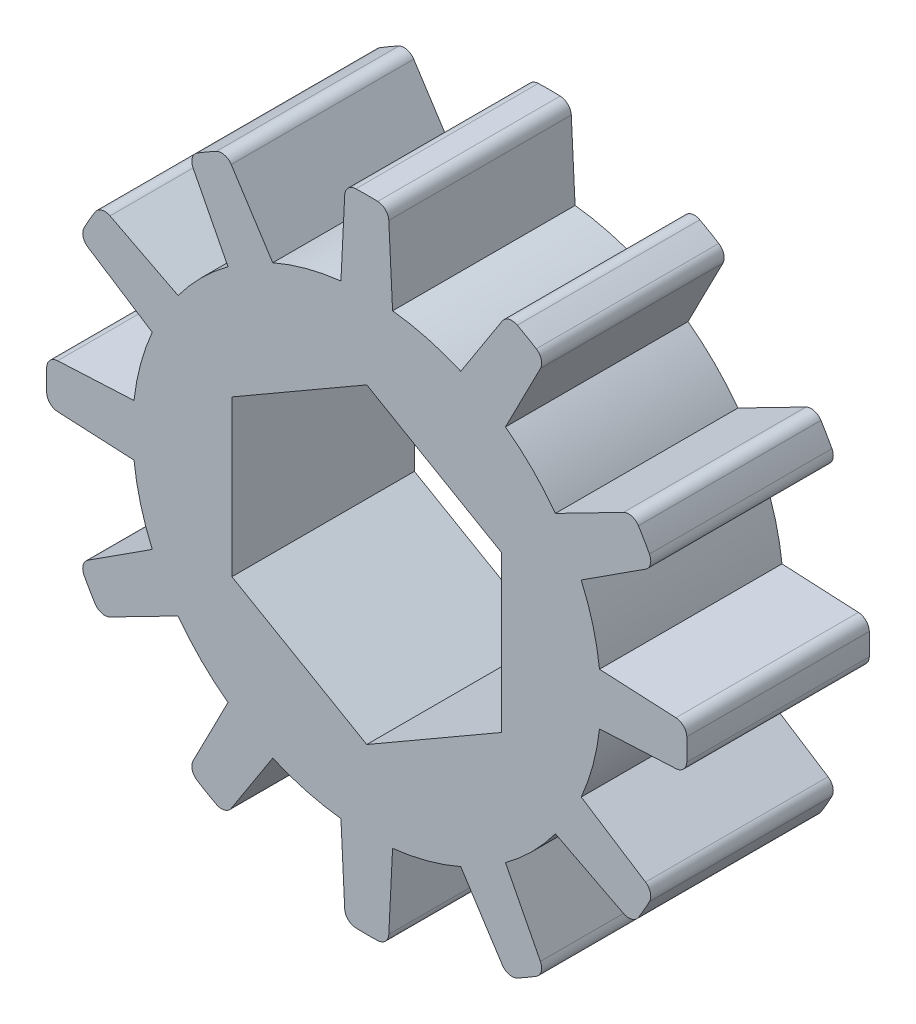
ISO-10303-21;
HEADER;
FILE_DESCRIPTION(('STEP AP214'),'2;1');
FILE_NAME('part.step','',(''),(''),'','','');
FILE_SCHEMA(('AUTOMOTIVE_DESIGN { 1 0 10303 214 1 1 1 1 }'));
ENDSEC;
DATA;
#1=APPLICATION_CONTEXT('core data for automotive mechanical design processes');
#2=APPLICATION_PROTOCOL_DEFINITION('international standard','automotive_design',2000,#1);
#3=PRODUCT_CONTEXT('',#1,'mechanical');
#4=PRODUCT('Part','Part','',(#3));
#5=PRODUCT_RELATED_PRODUCT_CATEGORY('part','',(#4));
#6=PRODUCT_DEFINITION_FORMATION('','',#4);
#7=PRODUCT_DEFINITION_CONTEXT('part definition',#1,'design');
#8=PRODUCT_DEFINITION('design','',#6,#7);
#9=PRODUCT_DEFINITION_SHAPE('','',#8);
#10=(LENGTH_UNIT() NAMED_UNIT(*) SI_UNIT(.MILLI.,.METRE.));
#11=(NAMED_UNIT(*) PLANE_ANGLE_UNIT() SI_UNIT($,.RADIAN.));
#12=(NAMED_UNIT(*) SI_UNIT($,.STERADIAN.) SOLID_ANGLE_UNIT());
#13=UNCERTAINTY_MEASURE_WITH_UNIT(LENGTH_MEASURE(1.E-05),#10,'distance_accuracy_value','');
#14=(GEOMETRIC_REPRESENTATION_CONTEXT(3) GLOBAL_UNCERTAINTY_ASSIGNED_CONTEXT((#13)) GLOBAL_UNIT_ASSIGNED_CONTEXT((#10,
#11,#12)) REPRESENTATION_CONTEXT('',''));
#15=CARTESIAN_POINT('',(0.,0.,0.));
#16=DIRECTION('',(0.,0.,1.));
#17=DIRECTION('',(1.,0.,0.));
#18=AXIS2_PLACEMENT_3D('',#15,#16,#17);
#19=CARTESIAN_POINT('',(0.,0.,3.18));
#20=DIRECTION('',(0.,0.,1.));
#21=DIRECTION('',(1.,0.,0.));
#22=AXIS2_PLACEMENT_3D('',#19,#20,#21);
#23=PLANE('',#22);
#24=DIRECTION('',(-0.866025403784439,-0.5,0.));
#25=VECTOR('',#24,1.);
#26=CARTESIAN_POINT('',(2.35,-1.35677313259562,3.18));
#27=LINE('',#26,#25);
#28=CARTESIAN_POINT('',(2.35,-1.35677313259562,3.18));
#29=VERTEX_POINT('',#28);
#30=CARTESIAN_POINT('',(0.,-2.71354626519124,3.18));
#31=VERTEX_POINT('',#30);
#32=EDGE_CURVE('E528',#29,#31,#27,.T.);
#33=ORIENTED_EDGE('',*,*,#32,.T.);
#34=DIRECTION('',(-0.866025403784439,0.5,0.));
#35=VECTOR('',#34,1.);
#36=CARTESIAN_POINT('',(0.,-2.71354626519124,3.18));
#37=LINE('',#36,#35);
#38=CARTESIAN_POINT('',(-2.35,-1.35677313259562,3.18));
#39=VERTEX_POINT('',#38);
#40=EDGE_CURVE('E540',#31,#39,#37,.T.);
#41=ORIENTED_EDGE('',*,*,#40,.T.);
#42=DIRECTION('',(0.,1.,0.));
#43=VECTOR('',#42,1.);
#44=CARTESIAN_POINT('',(-2.35,-1.35677313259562,3.18));
#45=LINE('',#44,#43);
#46=CARTESIAN_POINT('',(-2.35,1.35677313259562,3.18));
#47=VERTEX_POINT('',#46);
#48=EDGE_CURVE('E544',#39,#47,#45,.T.);
#49=ORIENTED_EDGE('',*,*,#48,.T.);
#50=DIRECTION('',(0.866025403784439,0.5,0.));
#51=VECTOR('',#50,1.);
#52=CARTESIAN_POINT('',(-2.35,1.35677313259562,3.18));
#53=LINE('',#52,#51);
#54=CARTESIAN_POINT('',(0.,2.71354626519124,3.18));
#55=VERTEX_POINT('',#54);
#56=EDGE_CURVE('E555',#47,#55,#53,.T.);
#57=ORIENTED_EDGE('',*,*,#56,.T.);
#58=DIRECTION('',(0.866025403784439,-0.5,0.));
#59=VECTOR('',#58,1.);
#60=CARTESIAN_POINT('',(0.,2.71354626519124,3.18));
#61=LINE('',#60,#59);
#62=CARTESIAN_POINT('',(2.35,1.35677313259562,3.18));
#63=VERTEX_POINT('',#62);
#64=EDGE_CURVE('E558',#55,#63,#61,.T.);
#65=ORIENTED_EDGE('',*,*,#64,.T.);
#66=DIRECTION('',(0.,-1.,0.));
#67=VECTOR('',#66,1.);
#68=CARTESIAN_POINT('',(2.35,1.35677313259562,3.18));
#69=LINE('',#68,#67);
#70=EDGE_CURVE('E536',#63,#29,#69,.T.);
#71=ORIENTED_EDGE('',*,*,#70,.T.);
#72=EDGE_LOOP('',(#33,#41,#49,#57,#65,#71));
#73=FACE_BOUND('',#72,.T.);
#74=DIRECTION('',(0.99877247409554,0.0495332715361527,0.));
#75=VECTOR('',#74,1.);
#76=CARTESIAN_POINT('',(5.56787554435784,-0.375,3.18));
#77=LINE('',#76,#75);
#78=CARTESIAN_POINT('',(4.0556003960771,-0.45,3.18));
#79=VERTEX_POINT('',#78);
#80=CARTESIAN_POINT('',(5.38724207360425,-0.383958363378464,3.18));
#81=VERTEX_POINT('',#80);
#82=EDGE_CURVE('E670',#79,#81,#77,.T.);
#83=ORIENTED_EDGE('',*,*,#82,.T.);
#84=CARTESIAN_POINT('',(5.37733541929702,-0.184203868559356,3.18));
#85=DIRECTION('',(0.,0.,1.));
#86=DIRECTION('',(1.,0.,0.));
#87=AXIS2_PLACEMENT_3D('',#84,#85,#86);
#88=CIRCLE('',#87,0.2);
#89=CARTESIAN_POINT('',(5.57721817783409,-0.191050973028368,3.18));
#90=VERTEX_POINT('',#89);
#91=EDGE_CURVE('E990',#81,#90,#88,.T.);
#92=ORIENTED_EDGE('',*,*,#91,.T.);
#93=CARTESIAN_POINT('',(0.,0.,3.18));
#94=DIRECTION('',(0.,0.,1.));
#95=DIRECTION('',(1.,0.,0.));
#96=AXIS2_PLACEMENT_3D('',#93,#94,#95);
#97=CIRCLE('',#96,5.58048950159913);
#98=CARTESIAN_POINT('',(5.57721817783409,0.191050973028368,3.18));
#99=VERTEX_POINT('',#98);
#100=EDGE_CURVE('E673',#90,#99,#97,.T.);
#101=ORIENTED_EDGE('',*,*,#100,.T.);
#102=CARTESIAN_POINT('',(5.37733541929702,0.184203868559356,3.18));
#103=DIRECTION('',(0.,0.,1.));
#104=DIRECTION('',(1.,0.,0.));
#105=AXIS2_PLACEMENT_3D('',#102,#103,#104);
#106=CIRCLE('',#105,0.2);
#107=CARTESIAN_POINT('',(5.38724207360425,0.383958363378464,3.18));
#108=VERTEX_POINT('',#107);
#109=EDGE_CURVE('E956',#99,#108,#106,.T.);
#110=ORIENTED_EDGE('',*,*,#109,.T.);
#111=DIRECTION('',(-0.99877247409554,0.0495332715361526,0.));
#112=VECTOR('',#111,1.);
#113=CARTESIAN_POINT('',(5.56787554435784,0.375,3.18));
#114=LINE('',#113,#112);
#115=CARTESIAN_POINT('',(4.0556003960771,0.45,3.18));
#116=VERTEX_POINT('',#115);
#117=EDGE_CURVE('E676',#108,#116,#114,.T.);
#118=ORIENTED_EDGE('',*,*,#117,.T.);
#119=CARTESIAN_POINT('',(0.,0.,3.18));
#120=DIRECTION('',(0.,0.,1.));
#121=DIRECTION('',(1.,0.,0.));
#122=AXIS2_PLACEMENT_3D('',#119,#120,#121);
#123=CIRCLE('',#122,4.08048950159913);
#124=CARTESIAN_POINT('',(3.737252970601,1.63808876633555,3.18));
#125=VERTEX_POINT('',#124);
#126=EDGE_CURVE('E678',#116,#125,#123,.T.);
#127=ORIENTED_EDGE('',*,*,#126,.T.);
#128=DIRECTION('',(0.840195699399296,0.542283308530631,0.));
#129=VECTOR('',#128,1.);
#130=CARTESIAN_POINT('',(5.009421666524,2.45917824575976,3.18));
#131=LINE('',#130,#129);
#132=CARTESIAN_POINT('',(4.85746767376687,2.36110334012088,3.18));
#133=VERTEX_POINT('',#132);
#134=EDGE_CURVE('E680',#125,#133,#131,.T.);
#135=ORIENTED_EDGE('',*,*,#134,.T.);
#136=CARTESIAN_POINT('',(4.74901101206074,2.52914248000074,3.18));
#137=DIRECTION('',(0.,0.,1.));
#138=DIRECTION('',(1.,0.,0.));
#139=AXIS2_PLACEMENT_3D('',#136,#137,#138);
#140=CIRCLE('',#139,0.2);
#141=CARTESIAN_POINT('',(4.92553811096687,2.62315409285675,3.18));
#142=VERTEX_POINT('',#141);
#143=EDGE_CURVE('E954',#133,#142,#140,.T.);
#144=ORIENTED_EDGE('',*,*,#143,.T.);
#145=CARTESIAN_POINT('',(0.,0.,3.18));
#146=DIRECTION('',(0.,0.,1.));
#147=DIRECTION('',(1.,0.,0.));
#148=AXIS2_PLACEMENT_3D('',#145,#146,#147);
#149=CIRCLE('',#148,5.58048950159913);
#150=CARTESIAN_POINT('',(4.7344871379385,2.95406408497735,3.18));
#151=VERTEX_POINT('',#150);
#152=EDGE_CURVE('E683',#142,#151,#149,.T.);
#153=ORIENTED_EDGE('',*,*,#152,.T.);
#154=CARTESIAN_POINT('',(4.56480714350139,2.84819293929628,3.18));
#155=DIRECTION('',(0.,0.,1.));
#156=DIRECTION('',(1.,0.,0.));
#157=AXIS2_PLACEMENT_3D('',#154,#155,#156);
#158=CIRCLE('',#157,0.2);
#159=CARTESIAN_POINT('',(4.4735093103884,3.02613873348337,3.18));
#160=VERTEX_POINT('',#159);
#161=EDGE_CURVE('E952',#151,#160,#158,.T.);
#162=ORIENTED_EDGE('',*,*,#161,.T.);
#163=DIRECTION('',(-0.889728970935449,-0.456489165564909,0.));
#164=VECTOR('',#163,1.);
#165=CARTESIAN_POINT('',(4.634421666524,3.10869729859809,3.18));
#166=LINE('',#165,#164);
#167=CARTESIAN_POINT('',(3.287252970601,2.41751162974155,3.18));
#168=VERTEX_POINT('',#167);
#169=EDGE_CURVE('E686',#160,#168,#166,.T.);
#170=ORIENTED_EDGE('',*,*,#169,.T.);
#171=CARTESIAN_POINT('',(0.,0.,3.18));
#172=DIRECTION('',(0.,0.,1.));
#173=DIRECTION('',(1.,0.,0.));
#174=AXIS2_PLACEMENT_3D('',#171,#172,#173);
#175=CIRCLE('',#174,4.08048950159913);
#176=CARTESIAN_POINT('',(2.41751162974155,3.287252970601,3.18));
#177=VERTEX_POINT('',#176);
#178=EDGE_CURVE('E688',#168,#177,#175,.T.);
#179=ORIENTED_EDGE('',*,*,#178,.T.);
#180=DIRECTION('',(0.456489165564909,0.889728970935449,0.));
#181=VECTOR('',#180,1.);
#182=CARTESIAN_POINT('',(3.10869729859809,4.634421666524,3.18));
#183=LINE('',#182,#181);
#184=CARTESIAN_POINT('',(3.02613873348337,4.47350931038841,3.18));
#185=VERTEX_POINT('',#184);
#186=EDGE_CURVE('E690',#177,#185,#183,.T.);
#187=ORIENTED_EDGE('',*,*,#186,.T.);
#188=CARTESIAN_POINT('',(2.84819293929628,4.56480714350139,3.18));
#189=DIRECTION('',(0.,0.,1.));
#190=DIRECTION('',(1.,0.,0.));
#191=AXIS2_PLACEMENT_3D('',#188,#189,#190);
#192=CIRCLE('',#191,0.2);
#193=CARTESIAN_POINT('',(2.95406408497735,4.7344871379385,3.18));
#194=VERTEX_POINT('',#193);
#195=EDGE_CURVE('E950',#185,#194,#192,.T.);
#196=ORIENTED_EDGE('',*,*,#195,.T.);
#197=CARTESIAN_POINT('',(0.,0.,3.18));
#198=DIRECTION('',(0.,0.,1.));
#199=DIRECTION('',(1.,0.,0.));
#200=AXIS2_PLACEMENT_3D('',#197,#198,#199);
#201=CIRCLE('',#200,5.58048950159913);
#202=CARTESIAN_POINT('',(2.62315409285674,4.92553811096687,3.18));
#203=VERTEX_POINT('',#202);
#204=EDGE_CURVE('E693',#194,#203,#201,.T.);
#205=ORIENTED_EDGE('',*,*,#204,.T.);
#206=CARTESIAN_POINT('',(2.52914248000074,4.74901101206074,3.18));
#207=DIRECTION('',(0.,0.,1.));
#208=DIRECTION('',(1.,0.,0.));
#209=AXIS2_PLACEMENT_3D('',#206,#207,#208);
#210=CIRCLE('',#209,0.2);
#211=CARTESIAN_POINT('',(2.36110334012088,4.85746767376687,3.18));
#212=VERTEX_POINT('',#211);
#213=EDGE_CURVE('E59',#203,#212,#210,.T.);
#214=ORIENTED_EDGE('',*,*,#213,.T.);
#215=DIRECTION('',(-0.54228330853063,-0.840195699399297,0.));
#216=VECTOR('',#215,1.);
#217=CARTESIAN_POINT('',(2.45917824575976,5.009421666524,3.18));
#218=LINE('',#217,#216);
#219=CARTESIAN_POINT('',(1.63808876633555,3.737252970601,3.18));
#220=VERTEX_POINT('',#219);
#221=EDGE_CURVE('E695',#212,#220,#218,.T.);
#222=ORIENTED_EDGE('',*,*,#221,.T.);
#223=CARTESIAN_POINT('',(0.,0.,3.18));
#224=DIRECTION('',(0.,0.,1.));
#225=DIRECTION('',(1.,0.,0.));
#226=AXIS2_PLACEMENT_3D('',#223,#224,#225);
#227=CIRCLE('',#226,4.08048950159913);
#228=CARTESIAN_POINT('',(0.45,4.0556003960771,3.18));
#229=VERTEX_POINT('',#228);
#230=EDGE_CURVE('E697',#220,#229,#227,.T.);
#231=ORIENTED_EDGE('',*,*,#230,.T.);
#232=DIRECTION('',(-0.0495332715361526,0.99877247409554,0.));
#233=VECTOR('',#232,1.);
#234=CARTESIAN_POINT('',(0.375,5.56787554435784,3.18));
#235=LINE('',#234,#233);
#236=CARTESIAN_POINT('',(0.383958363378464,5.38724207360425,3.18));
#237=VERTEX_POINT('',#236);
#238=EDGE_CURVE('E699',#229,#237,#235,.T.);
#239=ORIENTED_EDGE('',*,*,#238,.T.);
#240=CARTESIAN_POINT('',(0.184203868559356,5.37733541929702,3.18));
#241=DIRECTION('',(0.,0.,1.));
#242=DIRECTION('',(1.,0.,0.));
#243=AXIS2_PLACEMENT_3D('',#240,#241,#242);
#244=CIRCLE('',#243,0.2);
#245=CARTESIAN_POINT('',(0.191050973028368,5.57721817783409,3.18));
#246=VERTEX_POINT('',#245);
#247=EDGE_CURVE('E947',#237,#246,#244,.T.);
#248=ORIENTED_EDGE('',*,*,#247,.T.);
#249=CARTESIAN_POINT('',(0.,0.,3.18));
#250=DIRECTION('',(0.,0.,1.));
#251=DIRECTION('',(1.,0.,0.));
#252=AXIS2_PLACEMENT_3D('',#249,#250,#251);
#253=CIRCLE('',#252,5.58048950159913);
#254=CARTESIAN_POINT('',(-0.191050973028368,5.57721817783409,3.18));
#255=VERTEX_POINT('',#254);
#256=EDGE_CURVE('E582',#246,#255,#253,.T.);
#257=ORIENTED_EDGE('',*,*,#256,.T.);
#258=CARTESIAN_POINT('',(-0.184203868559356,5.37733541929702,3.18));
#259=DIRECTION('',(0.,0.,1.));
#260=DIRECTION('',(1.,0.,0.));
#261=AXIS2_PLACEMENT_3D('',#258,#259,#260);
#262=CIRCLE('',#261,0.2);
#263=CARTESIAN_POINT('',(-0.383958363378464,5.38724207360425,3.18));
#264=VERTEX_POINT('',#263);
#265=EDGE_CURVE('E945',#255,#264,#262,.T.);
#266=ORIENTED_EDGE('',*,*,#265,.T.);
#267=DIRECTION('',(-0.0495332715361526,-0.99877247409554,0.));
#268=VECTOR('',#267,1.);
#269=CARTESIAN_POINT('',(-0.375,5.56787554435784,3.18));
#270=LINE('',#269,#268);
#271=CARTESIAN_POINT('',(-0.45,4.0556003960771,3.18));
#272=VERTEX_POINT('',#271);
#273=EDGE_CURVE('E585',#264,#272,#270,.T.);
#274=ORIENTED_EDGE('',*,*,#273,.T.);
#275=CARTESIAN_POINT('',(0.,0.,3.18));
#276=DIRECTION('',(0.,0.,1.));
#277=DIRECTION('',(1.,0.,0.));
#278=AXIS2_PLACEMENT_3D('',#275,#276,#277);
#279=CIRCLE('',#278,4.08048950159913);
#280=CARTESIAN_POINT('',(-1.63808876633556,3.737252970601,3.18));
#281=VERTEX_POINT('',#280);
#282=EDGE_CURVE('E588',#272,#281,#279,.T.);
#283=ORIENTED_EDGE('',*,*,#282,.T.);
#284=DIRECTION('',(-0.542283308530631,0.840195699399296,0.));
#285=VECTOR('',#284,1.);
#286=CARTESIAN_POINT('',(-2.45917824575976,5.009421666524,3.18));
#287=LINE('',#286,#285);
#288=CARTESIAN_POINT('',(-2.36110334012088,4.85746767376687,3.18));
#289=VERTEX_POINT('',#288);
#290=EDGE_CURVE('E590',#281,#289,#287,.T.);
#291=ORIENTED_EDGE('',*,*,#290,.T.);
#292=CARTESIAN_POINT('',(-2.52914248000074,4.74901101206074,3.18));
#293=DIRECTION('',(0.,0.,1.));
#294=DIRECTION('',(1.,0.,0.));
#295=AXIS2_PLACEMENT_3D('',#292,#293,#294);
#296=CIRCLE('',#295,0.2);
#297=CARTESIAN_POINT('',(-2.62315409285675,4.92553811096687,3.18));
#298=VERTEX_POINT('',#297);
#299=EDGE_CURVE('E958',#289,#298,#296,.T.);
#300=ORIENTED_EDGE('',*,*,#299,.T.);
#301=CARTESIAN_POINT('',(0.,0.,3.18));
#302=DIRECTION('',(0.,0.,1.));
#303=DIRECTION('',(1.,0.,0.));
#304=AXIS2_PLACEMENT_3D('',#301,#302,#303);
#305=CIRCLE('',#304,5.58048950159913);
#306=CARTESIAN_POINT('',(-2.95406408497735,4.7344871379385,3.18));
#307=VERTEX_POINT('',#306);
#308=EDGE_CURVE('E593',#298,#307,#305,.T.);
#309=ORIENTED_EDGE('',*,*,#308,.T.);
#310=CARTESIAN_POINT('',(-2.84819293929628,4.56480714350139,3.18));
#311=DIRECTION('',(0.,0.,1.));
#312=DIRECTION('',(1.,0.,0.));
#313=AXIS2_PLACEMENT_3D('',#310,#311,#312);
#314=CIRCLE('',#313,0.2);
#315=CARTESIAN_POINT('',(-3.02613873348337,4.4735093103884,3.18));
#316=VERTEX_POINT('',#315);
#317=EDGE_CURVE('E960',#307,#316,#314,.T.);
#318=ORIENTED_EDGE('',*,*,#317,.T.);
#319=DIRECTION('',(0.456489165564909,-0.889728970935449,0.));
#320=VECTOR('',#319,1.);
#321=CARTESIAN_POINT('',(-3.10869729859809,4.634421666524,3.18));
#322=LINE('',#321,#320);
#323=CARTESIAN_POINT('',(-2.41751162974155,3.287252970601,3.18));
#324=VERTEX_POINT('',#323);
#325=EDGE_CURVE('E596',#316,#324,#322,.T.);
#326=ORIENTED_EDGE('',*,*,#325,.T.);
#327=CARTESIAN_POINT('',(0.,0.,3.18));
#328=DIRECTION('',(0.,0.,1.));
#329=DIRECTION('',(1.,0.,0.));
#330=AXIS2_PLACEMENT_3D('',#327,#328,#329);
#331=CIRCLE('',#330,4.08048950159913);
#332=CARTESIAN_POINT('',(-3.287252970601,2.41751162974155,3.18));
#333=VERTEX_POINT('',#332);
#334=EDGE_CURVE('E598',#324,#333,#331,.T.);
#335=ORIENTED_EDGE('',*,*,#334,.T.);
#336=DIRECTION('',(-0.889728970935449,0.456489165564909,0.));
#337=VECTOR('',#336,1.);
#338=CARTESIAN_POINT('',(-4.634421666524,3.10869729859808,3.18));
#339=LINE('',#338,#337);
#340=CARTESIAN_POINT('',(-4.47350931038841,3.02613873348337,3.18));
#341=VERTEX_POINT('',#340);
#342=EDGE_CURVE('E600',#333,#341,#339,.T.);
#343=ORIENTED_EDGE('',*,*,#342,.T.);
#344=CARTESIAN_POINT('',(-4.56480714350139,2.84819293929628,3.18));
#345=DIRECTION('',(0.,0.,1.));
#346=DIRECTION('',(1.,0.,0.));
#347=AXIS2_PLACEMENT_3D('',#344,#345,#346);
#348=CIRCLE('',#347,0.2);
#349=CARTESIAN_POINT('',(-4.7344871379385,2.95406408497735,3.18));
#350=VERTEX_POINT('',#349);
#351=EDGE_CURVE('E962',#341,#350,#348,.T.);
#352=ORIENTED_EDGE('',*,*,#351,.T.);
#353=CARTESIAN_POINT('',(0.,0.,3.18));
#354=DIRECTION('',(0.,0.,1.));
#355=DIRECTION('',(1.,0.,0.));
#356=AXIS2_PLACEMENT_3D('',#353,#354,#355);
#357=CIRCLE('',#356,5.58048950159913);
#358=CARTESIAN_POINT('',(-4.92553811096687,2.62315409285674,3.18));
#359=VERTEX_POINT('',#358);
#360=EDGE_CURVE('E603',#350,#359,#357,.T.);
#361=ORIENTED_EDGE('',*,*,#360,.T.);
#362=CARTESIAN_POINT('',(-4.74901101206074,2.52914248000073,3.18));
#363=DIRECTION('',(0.,0.,1.));
#364=DIRECTION('',(1.,0.,0.));
#365=AXIS2_PLACEMENT_3D('',#362,#363,#364);
#366=CIRCLE('',#365,0.2);
#367=CARTESIAN_POINT('',(-4.85746767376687,2.36110334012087,3.18));
#368=VERTEX_POINT('',#367);
#369=EDGE_CURVE('E964',#359,#368,#366,.T.);
#370=ORIENTED_EDGE('',*,*,#369,.T.);
#371=DIRECTION('',(0.840195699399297,-0.54228330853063,0.));
#372=VECTOR('',#371,1.);
#373=CARTESIAN_POINT('',(-5.009421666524,2.45917824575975,3.18));
#374=LINE('',#373,#372);
#375=CARTESIAN_POINT('',(-3.737252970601,1.63808876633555,3.18));
#376=VERTEX_POINT('',#375);
#377=EDGE_CURVE('E606',#368,#376,#374,.T.);
#378=ORIENTED_EDGE('',*,*,#377,.T.);
#379=CARTESIAN_POINT('',(0.,0.,3.18));
#380=DIRECTION('',(0.,0.,1.));
#381=DIRECTION('',(1.,0.,0.));
#382=AXIS2_PLACEMENT_3D('',#379,#380,#381);
#383=CIRCLE('',#382,4.08048950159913);
#384=CARTESIAN_POINT('',(-4.0556003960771,0.449999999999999,3.18));
#385=VERTEX_POINT('',#384);
#386=EDGE_CURVE('E608',#376,#385,#383,.T.);
#387=ORIENTED_EDGE('',*,*,#386,.T.);
#388=DIRECTION('',(-0.99877247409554,-0.0495332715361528,0.));
#389=VECTOR('',#388,1.);
#390=CARTESIAN_POINT('',(-5.56787554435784,0.374999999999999,3.18));
#391=LINE('',#390,#389);
#392=CARTESIAN_POINT('',(-5.38724207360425,0.383958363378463,3.18));
#393=VERTEX_POINT('',#392);
#394=EDGE_CURVE('E610',#385,#393,#391,.T.);
#395=ORIENTED_EDGE('',*,*,#394,.T.);
#396=CARTESIAN_POINT('',(-5.37733541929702,0.184203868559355,3.18));
#397=DIRECTION('',(0.,0.,1.));
#398=DIRECTION('',(1.,0.,0.));
#399=AXIS2_PLACEMENT_3D('',#396,#397,#398);
#400=CIRCLE('',#399,0.2);
#401=CARTESIAN_POINT('',(-5.57721817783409,0.191050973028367,3.18));
#402=VERTEX_POINT('',#401);
#403=EDGE_CURVE('E966',#393,#402,#400,.T.);
#404=ORIENTED_EDGE('',*,*,#403,.T.);
#405=CARTESIAN_POINT('',(0.,0.,3.18));
#406=DIRECTION('',(0.,0.,1.));
#407=DIRECTION('',(1.,0.,0.));
#408=AXIS2_PLACEMENT_3D('',#405,#406,#407);
#409=CIRCLE('',#408,5.58048950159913);
#410=CARTESIAN_POINT('',(-5.57721817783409,-0.191050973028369,3.18));
#411=VERTEX_POINT('',#410);
#412=EDGE_CURVE('E613',#402,#411,#409,.T.);
#413=ORIENTED_EDGE('',*,*,#412,.T.);
#414=CARTESIAN_POINT('',(-5.37733541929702,-0.184203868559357,3.18));
#415=DIRECTION('',(0.,0.,1.));
#416=DIRECTION('',(1.,0.,0.));
#417=AXIS2_PLACEMENT_3D('',#414,#415,#416);
#418=CIRCLE('',#417,0.2);
#419=CARTESIAN_POINT('',(-5.38724207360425,-0.383958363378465,3.18));
#420=VERTEX_POINT('',#419);
#421=EDGE_CURVE('E968',#411,#420,#418,.T.);
#422=ORIENTED_EDGE('',*,*,#421,.T.);
#423=DIRECTION('',(0.99877247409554,-0.0495332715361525,0.));
#424=VECTOR('',#423,1.);
#425=CARTESIAN_POINT('',(-5.56787554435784,-0.375000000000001,3.18));
#426=LINE('',#425,#424);
#427=CARTESIAN_POINT('',(-4.0556003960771,-0.449999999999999,3.18));
#428=VERTEX_POINT('',#427);
#429=EDGE_CURVE('E616',#420,#428,#426,.T.);
#430=ORIENTED_EDGE('',*,*,#429,.T.);
#431=CARTESIAN_POINT('',(0.,0.,3.18));
#432=DIRECTION('',(0.,0.,1.));
#433=DIRECTION('',(1.,0.,0.));
#434=AXIS2_PLACEMENT_3D('',#431,#432,#433);
#435=CIRCLE('',#434,4.08048950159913);
#436=CARTESIAN_POINT('',(-3.737252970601,-1.63808876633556,3.18));
#437=VERTEX_POINT('',#436);
#438=EDGE_CURVE('E618',#428,#437,#435,.T.);
#439=ORIENTED_EDGE('',*,*,#438,.T.);
#440=DIRECTION('',(-0.840195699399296,-0.542283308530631,0.));
#441=VECTOR('',#440,1.);
#442=CARTESIAN_POINT('',(-5.009421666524,-2.45917824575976,3.18));
#443=LINE('',#442,#441);
#444=CARTESIAN_POINT('',(-4.85746767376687,-2.36110334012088,3.18));
#445=VERTEX_POINT('',#444);
#446=EDGE_CURVE('E620',#437,#445,#443,.T.);
#447=ORIENTED_EDGE('',*,*,#446,.T.);
#448=CARTESIAN_POINT('',(-4.74901101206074,-2.52914248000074,3.18));
#449=DIRECTION('',(0.,0.,1.));
#450=DIRECTION('',(1.,0.,0.));
#451=AXIS2_PLACEMENT_3D('',#448,#449,#450);
#452=CIRCLE('',#451,0.2);
#453=CARTESIAN_POINT('',(-4.92553811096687,-2.62315409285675,3.18));
#454=VERTEX_POINT('',#453);
#455=EDGE_CURVE('E970',#445,#454,#452,.T.);
#456=ORIENTED_EDGE('',*,*,#455,.T.);
#457=CARTESIAN_POINT('',(0.,0.,3.18));
#458=DIRECTION('',(0.,0.,1.));
#459=DIRECTION('',(1.,0.,0.));
#460=AXIS2_PLACEMENT_3D('',#457,#458,#459);
#461=CIRCLE('',#460,5.58048950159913);
#462=CARTESIAN_POINT('',(-4.7344871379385,-2.95406408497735,3.18));
#463=VERTEX_POINT('',#462);
#464=EDGE_CURVE('E623',#454,#463,#461,.T.);
#465=ORIENTED_EDGE('',*,*,#464,.T.);
#466=CARTESIAN_POINT('',(-4.56480714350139,-2.84819293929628,3.18));
#467=DIRECTION('',(0.,0.,1.));
#468=DIRECTION('',(1.,0.,0.));
#469=AXIS2_PLACEMENT_3D('',#466,#467,#468);
#470=CIRCLE('',#469,0.2);
#471=CARTESIAN_POINT('',(-4.4735093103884,-3.02613873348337,3.18));
#472=VERTEX_POINT('',#471);
#473=EDGE_CURVE('E972',#463,#472,#470,.T.);
#474=ORIENTED_EDGE('',*,*,#473,.T.);
#475=DIRECTION('',(0.889728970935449,0.456489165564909,0.));
#476=VECTOR('',#475,1.);
#477=CARTESIAN_POINT('',(-4.634421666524,-3.10869729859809,3.18));
#478=LINE('',#477,#476);
#479=CARTESIAN_POINT('',(-3.287252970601,-2.41751162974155,3.18));
#480=VERTEX_POINT('',#479);
#481=EDGE_CURVE('E626',#472,#480,#478,.T.);
#482=ORIENTED_EDGE('',*,*,#481,.T.);
#483=CARTESIAN_POINT('',(0.,0.,3.18));
#484=DIRECTION('',(0.,0.,1.));
#485=DIRECTION('',(1.,0.,0.));
#486=AXIS2_PLACEMENT_3D('',#483,#484,#485);
#487=CIRCLE('',#486,4.08048950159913);
#488=CARTESIAN_POINT('',(-2.41751162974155,-3.287252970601,3.18));
#489=VERTEX_POINT('',#488);
#490=EDGE_CURVE('E628',#480,#489,#487,.T.);
#491=ORIENTED_EDGE('',*,*,#490,.T.);
#492=DIRECTION('',(-0.456489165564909,-0.889728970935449,0.));
#493=VECTOR('',#492,1.);
#494=CARTESIAN_POINT('',(-3.10869729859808,-4.634421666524,3.18));
#495=LINE('',#494,#493);
#496=CARTESIAN_POINT('',(-3.02613873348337,-4.47350931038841,3.18));
#497=VERTEX_POINT('',#496);
#498=EDGE_CURVE('E630',#489,#497,#495,.T.);
#499=ORIENTED_EDGE('',*,*,#498,.T.);
#500=CARTESIAN_POINT('',(-2.84819293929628,-4.56480714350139,3.18));
#501=DIRECTION('',(0.,0.,1.));
#502=DIRECTION('',(1.,0.,0.));
#503=AXIS2_PLACEMENT_3D('',#500,#501,#502);
#504=CIRCLE('',#503,0.2);
#505=CARTESIAN_POINT('',(-2.95406408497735,-4.7344871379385,3.18));
#506=VERTEX_POINT('',#505);
#507=EDGE_CURVE('E986',#497,#506,#504,.T.);
#508=ORIENTED_EDGE('',*,*,#507,.T.);
#509=CARTESIAN_POINT('',(0.,0.,3.18));
#510=DIRECTION('',(0.,0.,1.));
#511=DIRECTION('',(1.,0.,0.));
#512=AXIS2_PLACEMENT_3D('',#509,#510,#511);
#513=CIRCLE('',#512,5.58048950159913);
#514=CARTESIAN_POINT('',(-2.62315409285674,-4.92553811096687,3.18));
#515=VERTEX_POINT('',#514);
#516=EDGE_CURVE('E633',#506,#515,#513,.T.);
#517=ORIENTED_EDGE('',*,*,#516,.T.);
#518=CARTESIAN_POINT('',(-2.52914248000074,-4.74901101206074,3.18));
#519=DIRECTION('',(0.,0.,1.));
#520=DIRECTION('',(1.,0.,0.));
#521=AXIS2_PLACEMENT_3D('',#518,#519,#520);
#522=CIRCLE('',#521,0.2);
#523=CARTESIAN_POINT('',(-2.36110334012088,-4.85746767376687,3.18));
#524=VERTEX_POINT('',#523);
#525=EDGE_CURVE('E988',#515,#524,#522,.T.);
#526=ORIENTED_EDGE('',*,*,#525,.T.);
#527=DIRECTION('',(0.542283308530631,0.840195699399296,0.));
#528=VECTOR('',#527,1.);
#529=CARTESIAN_POINT('',(-2.45917824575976,-5.009421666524,3.18));
#530=LINE('',#529,#528);
#531=CARTESIAN_POINT('',(-1.63808876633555,-3.737252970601,3.18));
#532=VERTEX_POINT('',#531);
#533=EDGE_CURVE('E636',#524,#532,#530,.T.);
#534=ORIENTED_EDGE('',*,*,#533,.T.);
#535=CARTESIAN_POINT('',(0.,0.,3.18));
#536=DIRECTION('',(0.,0.,1.));
#537=DIRECTION('',(1.,0.,0.));
#538=AXIS2_PLACEMENT_3D('',#535,#536,#537);
#539=CIRCLE('',#538,4.08048950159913);
#540=CARTESIAN_POINT('',(-0.45,-4.0556003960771,3.18));
#541=VERTEX_POINT('',#540);
#542=EDGE_CURVE('E638',#532,#541,#539,.T.);
#543=ORIENTED_EDGE('',*,*,#542,.T.);
#544=DIRECTION('',(0.0495332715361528,-0.99877247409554,0.));
#545=VECTOR('',#544,1.);
#546=CARTESIAN_POINT('',(-0.374999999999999,-5.56787554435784,3.18));
#547=LINE('',#546,#545);
#548=CARTESIAN_POINT('',(-0.383958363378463,-5.38724207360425,3.18));
#549=VERTEX_POINT('',#548);
#550=EDGE_CURVE('E640',#541,#549,#547,.T.);
#551=ORIENTED_EDGE('',*,*,#550,.T.);
#552=CARTESIAN_POINT('',(-0.184203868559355,-5.37733541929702,3.18));
#553=DIRECTION('',(0.,0.,1.));
#554=DIRECTION('',(1.,0.,0.));
#555=AXIS2_PLACEMENT_3D('',#552,#553,#554);
#556=CIRCLE('',#555,0.2);
#557=CARTESIAN_POINT('',(-0.191050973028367,-5.57721817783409,3.18));
#558=VERTEX_POINT('',#557);
#559=EDGE_CURVE('E982',#549,#558,#556,.T.);
#560=ORIENTED_EDGE('',*,*,#559,.T.);
#561=CARTESIAN_POINT('',(0.,0.,3.18));
#562=DIRECTION('',(0.,0.,1.));
#563=DIRECTION('',(1.,0.,0.));
#564=AXIS2_PLACEMENT_3D('',#561,#562,#563);
#565=CIRCLE('',#564,5.58048950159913);
#566=CARTESIAN_POINT('',(0.191050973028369,-5.57721817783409,3.18));
#567=VERTEX_POINT('',#566);
#568=EDGE_CURVE('E643',#558,#567,#565,.T.);
#569=ORIENTED_EDGE('',*,*,#568,.T.);
#570=CARTESIAN_POINT('',(0.184203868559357,-5.37733541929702,3.18));
#571=DIRECTION('',(0.,0.,1.));
#572=DIRECTION('',(1.,0.,0.));
#573=AXIS2_PLACEMENT_3D('',#570,#571,#572);
#574=CIRCLE('',#573,0.2);
#575=CARTESIAN_POINT('',(0.383958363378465,-5.38724207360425,3.18));
#576=VERTEX_POINT('',#575);
#577=EDGE_CURVE('E984',#567,#576,#574,.T.);
#578=ORIENTED_EDGE('',*,*,#577,.T.);
#579=DIRECTION('',(0.0495332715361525,0.99877247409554,0.));
#580=VECTOR('',#579,1.);
#581=CARTESIAN_POINT('',(0.375000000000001,-5.56787554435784,3.18));
#582=LINE('',#581,#580);
#583=CARTESIAN_POINT('',(0.449999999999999,-4.0556003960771,3.18));
#584=VERTEX_POINT('',#583);
#585=EDGE_CURVE('E646',#576,#584,#582,.T.);
#586=ORIENTED_EDGE('',*,*,#585,.T.);
#587=CARTESIAN_POINT('',(0.,0.,3.18));
#588=DIRECTION('',(0.,0.,1.));
#589=DIRECTION('',(1.,0.,0.));
#590=AXIS2_PLACEMENT_3D('',#587,#588,#589);
#591=CIRCLE('',#590,4.08048950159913);
#592=CARTESIAN_POINT('',(1.63808876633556,-3.737252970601,3.18));
#593=VERTEX_POINT('',#592);
#594=EDGE_CURVE('E648',#584,#593,#591,.T.);
#595=ORIENTED_EDGE('',*,*,#594,.T.);
#596=DIRECTION('',(0.542283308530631,-0.840195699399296,0.));
#597=VECTOR('',#596,1.);
#598=CARTESIAN_POINT('',(2.45917824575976,-5.009421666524,3.18));
#599=LINE('',#598,#597);
#600=CARTESIAN_POINT('',(2.36110334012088,-4.85746767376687,3.18));
#601=VERTEX_POINT('',#600);
#602=EDGE_CURVE('E650',#593,#601,#599,.T.);
#603=ORIENTED_EDGE('',*,*,#602,.T.);
#604=CARTESIAN_POINT('',(2.52914248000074,-4.74901101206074,3.18));
#605=DIRECTION('',(0.,0.,1.));
#606=DIRECTION('',(1.,0.,0.));
#607=AXIS2_PLACEMENT_3D('',#604,#605,#606);
#608=CIRCLE('',#607,0.2);
#609=CARTESIAN_POINT('',(2.62315409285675,-4.92553811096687,3.18));
#610=VERTEX_POINT('',#609);
#611=EDGE_CURVE('E978',#601,#610,#608,.T.);
#612=ORIENTED_EDGE('',*,*,#611,.T.);
#613=CARTESIAN_POINT('',(0.,0.,3.18));
#614=DIRECTION('',(0.,0.,1.));
#615=DIRECTION('',(1.,0.,0.));
#616=AXIS2_PLACEMENT_3D('',#613,#614,#615);
#617=CIRCLE('',#616,5.58048950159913);
#618=CARTESIAN_POINT('',(2.95406408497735,-4.7344871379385,3.18));
#619=VERTEX_POINT('',#618);
#620=EDGE_CURVE('E653',#610,#619,#617,.T.);
#621=ORIENTED_EDGE('',*,*,#620,.T.);
#622=CARTESIAN_POINT('',(2.84819293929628,-4.56480714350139,3.18));
#623=DIRECTION('',(0.,0.,1.));
#624=DIRECTION('',(1.,0.,0.));
#625=AXIS2_PLACEMENT_3D('',#622,#623,#624);
#626=CIRCLE('',#625,0.2);
#627=CARTESIAN_POINT('',(3.02613873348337,-4.4735093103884,3.18));
#628=VERTEX_POINT('',#627);
#629=EDGE_CURVE('E980',#619,#628,#626,.T.);
#630=ORIENTED_EDGE('',*,*,#629,.T.);
#631=DIRECTION('',(-0.456489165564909,0.889728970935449,0.));
#632=VECTOR('',#631,1.);
#633=CARTESIAN_POINT('',(3.10869729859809,-4.634421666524,3.18));
#634=LINE('',#633,#632);
#635=CARTESIAN_POINT('',(2.41751162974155,-3.287252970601,3.18));
#636=VERTEX_POINT('',#635);
#637=EDGE_CURVE('E656',#628,#636,#634,.T.);
#638=ORIENTED_EDGE('',*,*,#637,.T.);
#639=CARTESIAN_POINT('',(0.,0.,3.18));
#640=DIRECTION('',(0.,0.,1.));
#641=DIRECTION('',(1.,0.,0.));
#642=AXIS2_PLACEMENT_3D('',#639,#640,#641);
#643=CIRCLE('',#642,4.08048950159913);
#644=CARTESIAN_POINT('',(3.287252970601,-2.41751162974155,3.18));
#645=VERTEX_POINT('',#644);
#646=EDGE_CURVE('E658',#636,#645,#643,.T.);
#647=ORIENTED_EDGE('',*,*,#646,.T.);
#648=DIRECTION('',(0.889728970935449,-0.456489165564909,0.));
#649=VECTOR('',#648,1.);
#650=CARTESIAN_POINT('',(4.634421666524,-3.10869729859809,3.18));
#651=LINE('',#650,#649);
#652=CARTESIAN_POINT('',(4.4735093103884,-3.02613873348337,3.18));
#653=VERTEX_POINT('',#652);
#654=EDGE_CURVE('E660',#645,#653,#651,.T.);
#655=ORIENTED_EDGE('',*,*,#654,.T.);
#656=CARTESIAN_POINT('',(4.56480714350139,-2.84819293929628,3.18));
#657=DIRECTION('',(0.,0.,1.));
#658=DIRECTION('',(1.,0.,0.));
#659=AXIS2_PLACEMENT_3D('',#656,#657,#658);
#660=CIRCLE('',#659,0.2);
#661=CARTESIAN_POINT('',(4.7344871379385,-2.95406408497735,3.18));
#662=VERTEX_POINT('',#661);
#663=EDGE_CURVE('E974',#653,#662,#660,.T.);
#664=ORIENTED_EDGE('',*,*,#663,.T.);
#665=CARTESIAN_POINT('',(0.,0.,3.18));
#666=DIRECTION('',(0.,0.,1.));
#667=DIRECTION('',(1.,0.,0.));
#668=AXIS2_PLACEMENT_3D('',#665,#666,#667);
#669=CIRCLE('',#668,5.58048950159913);
#670=CARTESIAN_POINT('',(4.92553811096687,-2.62315409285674,3.18));
#671=VERTEX_POINT('',#670);
#672=EDGE_CURVE('E663',#662,#671,#669,.T.);
#673=ORIENTED_EDGE('',*,*,#672,.T.);
#674=CARTESIAN_POINT('',(4.74901101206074,-2.52914248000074,3.18));
#675=DIRECTION('',(0.,0.,1.));
#676=DIRECTION('',(1.,0.,0.));
#677=AXIS2_PLACEMENT_3D('',#674,#675,#676);
#678=CIRCLE('',#677,0.2);
#679=CARTESIAN_POINT('',(4.85746767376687,-2.36110334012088,3.18));
#680=VERTEX_POINT('',#679);
#681=EDGE_CURVE('E976',#671,#680,#678,.T.);
#682=ORIENTED_EDGE('',*,*,#681,.T.);
#683=DIRECTION('',(-0.840195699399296,0.542283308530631,0.));
#684=VECTOR('',#683,1.);
#685=CARTESIAN_POINT('',(5.009421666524,-2.45917824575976,3.18));
#686=LINE('',#685,#684);
#687=CARTESIAN_POINT('',(3.737252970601,-1.63808876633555,3.18));
#688=VERTEX_POINT('',#687);
#689=EDGE_CURVE('E666',#680,#688,#686,.T.);
#690=ORIENTED_EDGE('',*,*,#689,.T.);
#691=CARTESIAN_POINT('',(0.,0.,3.18));
#692=DIRECTION('',(0.,0.,1.));
#693=DIRECTION('',(1.,0.,0.));
#694=AXIS2_PLACEMENT_3D('',#691,#692,#693);
#695=CIRCLE('',#694,4.08048950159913);
#696=EDGE_CURVE('E668',#688,#79,#695,.T.);
#697=ORIENTED_EDGE('',*,*,#696,.T.);
#698=EDGE_LOOP('',(#83,#92,#101,#110,#118,#127,#135,#144,#153,#162,#170,#179,#187,#196,#205,
#214,#222,#231,#239,#248,#257,#266,#274,#283,#291,#300,#309,#318,#326,#335,#343,#352,#361,#370,
#378,#387,#395,#404,#413,#422,#430,#439,#447,#456,#465,#474,#482,#491,#499,#508,#517,#526,#534,
#543,#551,#560,#569,#578,#586,#595,#603,#612,#621,#630,#638,#647,#655,#664,#673,#682,#690,#697));
#699=FACE_BOUND('',#698,.T.);
#700=ADVANCED_FACE('F37',(#73,#699),#23,.T.);
#701=CARTESIAN_POINT('',(0.,0.,0.));
#702=DIRECTION('',(0.,0.,1.));
#703=DIRECTION('',(1.,0.,0.));
#704=AXIS2_PLACEMENT_3D('',#701,#702,#703);
#705=PLANE('',#704);
#706=DIRECTION('',(-0.866025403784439,0.5,0.));
#707=VECTOR('',#706,1.);
#708=CARTESIAN_POINT('',(0.,-2.71354626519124,0.));
#709=LINE('',#708,#707);
#710=CARTESIAN_POINT('',(0.,-2.71354626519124,0.));
#711=VERTEX_POINT('',#710);
#712=CARTESIAN_POINT('',(-2.35,-1.35677313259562,0.));
#713=VERTEX_POINT('',#712);
#714=EDGE_CURVE('E562',#711,#713,#709,.T.);
#715=ORIENTED_EDGE('',*,*,#714,.F.);
#716=DIRECTION('',(-0.866025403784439,-0.5,0.));
#717=VECTOR('',#716,1.);
#718=CARTESIAN_POINT('',(2.35,-1.35677313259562,0.));
#719=LINE('',#718,#717);
#720=CARTESIAN_POINT('',(2.35,-1.35677313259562,0.));
#721=VERTEX_POINT('',#720);
#722=EDGE_CURVE('E531',#721,#711,#719,.T.);
#723=ORIENTED_EDGE('',*,*,#722,.F.);
#724=DIRECTION('',(0.,-1.,0.));
#725=VECTOR('',#724,1.);
#726=CARTESIAN_POINT('',(2.35,1.35677313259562,0.));
#727=LINE('',#726,#725);
#728=CARTESIAN_POINT('',(2.35,1.35677313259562,0.));
#729=VERTEX_POINT('',#728);
#730=EDGE_CURVE('E548',#729,#721,#727,.T.);
#731=ORIENTED_EDGE('',*,*,#730,.F.);
#732=DIRECTION('',(0.866025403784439,-0.5,0.));
#733=VECTOR('',#732,1.);
#734=CARTESIAN_POINT('',(0.,2.71354626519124,0.));
#735=LINE('',#734,#733);
#736=CARTESIAN_POINT('',(0.,2.71354626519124,0.));
#737=VERTEX_POINT('',#736);
#738=EDGE_CURVE('E551',#737,#729,#735,.T.);
#739=ORIENTED_EDGE('',*,*,#738,.F.);
#740=DIRECTION('',(0.866025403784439,0.5,0.));
#741=VECTOR('',#740,1.);
#742=CARTESIAN_POINT('',(-2.35,1.35677313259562,0.));
#743=LINE('',#742,#741);
#744=CARTESIAN_POINT('',(-2.35,1.35677313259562,0.));
#745=VERTEX_POINT('',#744);
#746=EDGE_CURVE('E567',#745,#737,#743,.T.);
#747=ORIENTED_EDGE('',*,*,#746,.F.);
#748=DIRECTION('',(0.,1.,0.));
#749=VECTOR('',#748,1.);
#750=CARTESIAN_POINT('',(-2.35,-1.35677313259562,0.));
#751=LINE('',#750,#749);
#752=EDGE_CURVE('E564',#713,#745,#751,.T.);
#753=ORIENTED_EDGE('',*,*,#752,.F.);
#754=EDGE_LOOP('',(#715,#723,#731,#739,#747,#753));
#755=FACE_BOUND('',#754,.T.);
#756=CARTESIAN_POINT('',(0.,0.,0.));
#757=DIRECTION('',(0.,0.,1.));
#758=DIRECTION('',(1.,0.,0.));
#759=AXIS2_PLACEMENT_3D('',#756,#757,#758);
#760=CIRCLE('',#759,5.58048950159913);
#761=CARTESIAN_POINT('',(5.57721817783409,-0.191050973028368,0.));
#762=VERTEX_POINT('',#761);
#763=CARTESIAN_POINT('',(5.57721817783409,0.191050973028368,0.));
#764=VERTEX_POINT('',#763);
#765=EDGE_CURVE('E791',#762,#764,#760,.T.);
#766=ORIENTED_EDGE('',*,*,#765,.F.);
#767=CARTESIAN_POINT('',(5.37733541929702,-0.184203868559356,0.));
#768=DIRECTION('',(0.,0.,1.));
#769=DIRECTION('',(1.,0.,0.));
#770=AXIS2_PLACEMENT_3D('',#767,#768,#769);
#771=CIRCLE('',#770,0.2);
#772=CARTESIAN_POINT('',(5.38724207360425,-0.383958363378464,0.));
#773=VERTEX_POINT('',#772);
#774=EDGE_CURVE('E941',#762,#773,#771,.F.);
#775=ORIENTED_EDGE('',*,*,#774,.T.);
#776=DIRECTION('',(0.99877247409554,0.0495332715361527,0.));
#777=VECTOR('',#776,1.);
#778=CARTESIAN_POINT('',(5.56787554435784,-0.375,0.));
#779=LINE('',#778,#777);
#780=CARTESIAN_POINT('',(4.0556003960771,-0.45,0.));
#781=VERTEX_POINT('',#780);
#782=EDGE_CURVE('E788',#781,#773,#779,.T.);
#783=ORIENTED_EDGE('',*,*,#782,.F.);
#784=CARTESIAN_POINT('',(0.,0.,0.));
#785=DIRECTION('',(0.,0.,1.));
#786=DIRECTION('',(1.,0.,0.));
#787=AXIS2_PLACEMENT_3D('',#784,#785,#786);
#788=CIRCLE('',#787,4.08048950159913);
#789=CARTESIAN_POINT('',(3.737252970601,-1.63808876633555,0.));
#790=VERTEX_POINT('',#789);
#791=EDGE_CURVE('E786',#790,#781,#788,.T.);
#792=ORIENTED_EDGE('',*,*,#791,.F.);
#793=DIRECTION('',(-0.840195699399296,0.542283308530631,0.));
#794=VECTOR('',#793,1.);
#795=CARTESIAN_POINT('',(5.009421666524,-2.45917824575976,0.));
#796=LINE('',#795,#794);
#797=CARTESIAN_POINT('',(4.85746767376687,-2.36110334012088,0.));
#798=VERTEX_POINT('',#797);
#799=EDGE_CURVE('E784',#798,#790,#796,.T.);
#800=ORIENTED_EDGE('',*,*,#799,.F.);
#801=CARTESIAN_POINT('',(4.74901101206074,-2.52914248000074,0.));
#802=DIRECTION('',(0.,0.,1.));
#803=DIRECTION('',(1.,0.,0.));
#804=AXIS2_PLACEMENT_3D('',#801,#802,#803);
#805=CIRCLE('',#804,0.2);
#806=CARTESIAN_POINT('',(4.92553811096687,-2.62315409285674,0.));
#807=VERTEX_POINT('',#806);
#808=EDGE_CURVE('E927',#798,#807,#805,.F.);
#809=ORIENTED_EDGE('',*,*,#808,.T.);
#810=CARTESIAN_POINT('',(0.,0.,0.));
#811=DIRECTION('',(0.,0.,1.));
#812=DIRECTION('',(1.,0.,0.));
#813=AXIS2_PLACEMENT_3D('',#810,#811,#812);
#814=CIRCLE('',#813,5.58048950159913);
#815=CARTESIAN_POINT('',(4.7344871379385,-2.95406408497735,0.));
#816=VERTEX_POINT('',#815);
#817=EDGE_CURVE('E781',#816,#807,#814,.T.);
#818=ORIENTED_EDGE('',*,*,#817,.F.);
#819=CARTESIAN_POINT('',(4.56480714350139,-2.84819293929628,0.));
#820=DIRECTION('',(0.,0.,1.));
#821=DIRECTION('',(1.,0.,0.));
#822=AXIS2_PLACEMENT_3D('',#819,#820,#821);
#823=CIRCLE('',#822,0.2);
#824=CARTESIAN_POINT('',(4.4735093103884,-3.02613873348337,0.));
#825=VERTEX_POINT('',#824);
#826=EDGE_CURVE('E925',#816,#825,#823,.F.);
#827=ORIENTED_EDGE('',*,*,#826,.T.);
#828=DIRECTION('',(0.889728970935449,-0.456489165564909,0.));
#829=VECTOR('',#828,1.);
#830=CARTESIAN_POINT('',(4.634421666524,-3.10869729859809,0.));
#831=LINE('',#830,#829);
#832=CARTESIAN_POINT('',(3.287252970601,-2.41751162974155,0.));
#833=VERTEX_POINT('',#832);
#834=EDGE_CURVE('E778',#833,#825,#831,.T.);
#835=ORIENTED_EDGE('',*,*,#834,.F.);
#836=CARTESIAN_POINT('',(0.,0.,0.));
#837=DIRECTION('',(0.,0.,1.));
#838=DIRECTION('',(1.,0.,0.));
#839=AXIS2_PLACEMENT_3D('',#836,#837,#838);
#840=CIRCLE('',#839,4.08048950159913);
#841=CARTESIAN_POINT('',(2.41751162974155,-3.287252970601,0.));
#842=VERTEX_POINT('',#841);
#843=EDGE_CURVE('E776',#842,#833,#840,.T.);
#844=ORIENTED_EDGE('',*,*,#843,.F.);
#845=DIRECTION('',(-0.456489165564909,0.889728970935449,0.));
#846=VECTOR('',#845,1.);
#847=CARTESIAN_POINT('',(3.10869729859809,-4.634421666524,0.));
#848=LINE('',#847,#846);
#849=CARTESIAN_POINT('',(3.02613873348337,-4.4735093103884,0.));
#850=VERTEX_POINT('',#849);
#851=EDGE_CURVE('E774',#850,#842,#848,.T.);
#852=ORIENTED_EDGE('',*,*,#851,.F.);
#853=CARTESIAN_POINT('',(2.84819293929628,-4.56480714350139,0.));
#854=DIRECTION('',(0.,0.,1.));
#855=DIRECTION('',(1.,0.,0.));
#856=AXIS2_PLACEMENT_3D('',#853,#854,#855);
#857=CIRCLE('',#856,0.2);
#858=CARTESIAN_POINT('',(2.95406408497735,-4.7344871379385,0.));
#859=VERTEX_POINT('',#858);
#860=EDGE_CURVE('E931',#850,#859,#857,.F.);
#861=ORIENTED_EDGE('',*,*,#860,.T.);
#862=CARTESIAN_POINT('',(0.,0.,0.));
#863=DIRECTION('',(0.,0.,1.));
#864=DIRECTION('',(1.,0.,0.));
#865=AXIS2_PLACEMENT_3D('',#862,#863,#864);
#866=CIRCLE('',#865,5.58048950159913);
#867=CARTESIAN_POINT('',(2.62315409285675,-4.92553811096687,0.));
#868=VERTEX_POINT('',#867);
#869=EDGE_CURVE('E771',#868,#859,#866,.T.);
#870=ORIENTED_EDGE('',*,*,#869,.F.);
#871=CARTESIAN_POINT('',(2.52914248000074,-4.74901101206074,0.));
#872=DIRECTION('',(0.,0.,1.));
#873=DIRECTION('',(1.,0.,0.));
#874=AXIS2_PLACEMENT_3D('',#871,#872,#873);
#875=CIRCLE('',#874,0.2);
#876=CARTESIAN_POINT('',(2.36110334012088,-4.85746767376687,0.));
#877=VERTEX_POINT('',#876);
#878=EDGE_CURVE('E929',#868,#877,#875,.F.);
#879=ORIENTED_EDGE('',*,*,#878,.T.);
#880=DIRECTION('',(0.542283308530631,-0.840195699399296,0.));
#881=VECTOR('',#880,1.);
#882=CARTESIAN_POINT('',(2.45917824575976,-5.009421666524,0.));
#883=LINE('',#882,#881);
#884=CARTESIAN_POINT('',(1.63808876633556,-3.737252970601,0.));
#885=VERTEX_POINT('',#884);
#886=EDGE_CURVE('E768',#885,#877,#883,.T.);
#887=ORIENTED_EDGE('',*,*,#886,.F.);
#888=CARTESIAN_POINT('',(0.,0.,0.));
#889=DIRECTION('',(0.,0.,1.));
#890=DIRECTION('',(1.,0.,0.));
#891=AXIS2_PLACEMENT_3D('',#888,#889,#890);
#892=CIRCLE('',#891,4.08048950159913);
#893=CARTESIAN_POINT('',(0.449999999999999,-4.0556003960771,0.));
#894=VERTEX_POINT('',#893);
#895=EDGE_CURVE('E766',#894,#885,#892,.T.);
#896=ORIENTED_EDGE('',*,*,#895,.F.);
#897=DIRECTION('',(0.0495332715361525,0.99877247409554,0.));
#898=VECTOR('',#897,1.);
#899=CARTESIAN_POINT('',(0.375000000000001,-5.56787554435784,0.));
#900=LINE('',#899,#898);
#901=CARTESIAN_POINT('',(0.383958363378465,-5.38724207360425,0.));
#902=VERTEX_POINT('',#901);
#903=EDGE_CURVE('E764',#902,#894,#900,.T.);
#904=ORIENTED_EDGE('',*,*,#903,.F.);
#905=CARTESIAN_POINT('',(0.184203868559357,-5.37733541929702,0.));
#906=DIRECTION('',(0.,0.,1.));
#907=DIRECTION('',(1.,0.,0.));
#908=AXIS2_PLACEMENT_3D('',#905,#906,#907);
#909=CIRCLE('',#908,0.2);
#910=CARTESIAN_POINT('',(0.191050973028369,-5.57721817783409,0.));
#911=VERTEX_POINT('',#910);
#912=EDGE_CURVE('E935',#902,#911,#909,.F.);
#913=ORIENTED_EDGE('',*,*,#912,.T.);
#914=CARTESIAN_POINT('',(0.,0.,0.));
#915=DIRECTION('',(0.,0.,1.));
#916=DIRECTION('',(1.,0.,0.));
#917=AXIS2_PLACEMENT_3D('',#914,#915,#916);
#918=CIRCLE('',#917,5.58048950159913);
#919=CARTESIAN_POINT('',(-0.191050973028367,-5.57721817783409,0.));
#920=VERTEX_POINT('',#919);
#921=EDGE_CURVE('E761',#920,#911,#918,.T.);
#922=ORIENTED_EDGE('',*,*,#921,.F.);
#923=CARTESIAN_POINT('',(-0.184203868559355,-5.37733541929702,0.));
#924=DIRECTION('',(0.,0.,1.));
#925=DIRECTION('',(1.,0.,0.));
#926=AXIS2_PLACEMENT_3D('',#923,#924,#925);
#927=CIRCLE('',#926,0.2);
#928=CARTESIAN_POINT('',(-0.383958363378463,-5.38724207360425,0.));
#929=VERTEX_POINT('',#928);
#930=EDGE_CURVE('E933',#920,#929,#927,.F.);
#931=ORIENTED_EDGE('',*,*,#930,.T.);
#932=DIRECTION('',(0.0495332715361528,-0.99877247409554,0.));
#933=VECTOR('',#932,1.);
#934=CARTESIAN_POINT('',(-0.374999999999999,-5.56787554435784,0.));
#935=LINE('',#934,#933);
#936=CARTESIAN_POINT('',(-0.45,-4.0556003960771,0.));
#937=VERTEX_POINT('',#936);
#938=EDGE_CURVE('E758',#937,#929,#935,.T.);
#939=ORIENTED_EDGE('',*,*,#938,.F.);
#940=CARTESIAN_POINT('',(0.,0.,0.));
#941=DIRECTION('',(0.,0.,1.));
#942=DIRECTION('',(1.,0.,0.));
#943=AXIS2_PLACEMENT_3D('',#940,#941,#942);
#944=CIRCLE('',#943,4.08048950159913);
#945=CARTESIAN_POINT('',(-1.63808876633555,-3.737252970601,0.));
#946=VERTEX_POINT('',#945);
#947=EDGE_CURVE('E756',#946,#937,#944,.T.);
#948=ORIENTED_EDGE('',*,*,#947,.F.);
#949=DIRECTION('',(0.542283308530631,0.840195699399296,0.));
#950=VECTOR('',#949,1.);
#951=CARTESIAN_POINT('',(-2.45917824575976,-5.009421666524,0.));
#952=LINE('',#951,#950);
#953=CARTESIAN_POINT('',(-2.36110334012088,-4.85746767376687,0.));
#954=VERTEX_POINT('',#953);
#955=EDGE_CURVE('E754',#954,#946,#952,.T.);
#956=ORIENTED_EDGE('',*,*,#955,.F.);
#957=CARTESIAN_POINT('',(-2.52914248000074,-4.74901101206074,0.));
#958=DIRECTION('',(0.,0.,1.));
#959=DIRECTION('',(1.,0.,0.));
#960=AXIS2_PLACEMENT_3D('',#957,#958,#959);
#961=CIRCLE('',#960,0.2);
#962=CARTESIAN_POINT('',(-2.62315409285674,-4.92553811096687,0.));
#963=VERTEX_POINT('',#962);
#964=EDGE_CURVE('E939',#954,#963,#961,.F.);
#965=ORIENTED_EDGE('',*,*,#964,.T.);
#966=CARTESIAN_POINT('',(0.,0.,0.));
#967=DIRECTION('',(0.,0.,1.));
#968=DIRECTION('',(1.,0.,0.));
#969=AXIS2_PLACEMENT_3D('',#966,#967,#968);
#970=CIRCLE('',#969,5.58048950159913);
#971=CARTESIAN_POINT('',(-2.95406408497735,-4.7344871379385,0.));
#972=VERTEX_POINT('',#971);
#973=EDGE_CURVE('E751',#972,#963,#970,.T.);
#974=ORIENTED_EDGE('',*,*,#973,.F.);
#975=CARTESIAN_POINT('',(-2.84819293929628,-4.56480714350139,0.));
#976=DIRECTION('',(0.,0.,1.));
#977=DIRECTION('',(1.,0.,0.));
#978=AXIS2_PLACEMENT_3D('',#975,#976,#977);
#979=CIRCLE('',#978,0.2);
#980=CARTESIAN_POINT('',(-3.02613873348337,-4.47350931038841,0.));
#981=VERTEX_POINT('',#980);
#982=EDGE_CURVE('E937',#972,#981,#979,.F.);
#983=ORIENTED_EDGE('',*,*,#982,.T.);
#984=DIRECTION('',(-0.456489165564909,-0.889728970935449,0.));
#985=VECTOR('',#984,1.);
#986=CARTESIAN_POINT('',(-3.10869729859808,-4.634421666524,0.));
#987=LINE('',#986,#985);
#988=CARTESIAN_POINT('',(-2.41751162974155,-3.287252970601,0.));
#989=VERTEX_POINT('',#988);
#990=EDGE_CURVE('E748',#989,#981,#987,.T.);
#991=ORIENTED_EDGE('',*,*,#990,.F.);
#992=CARTESIAN_POINT('',(0.,0.,0.));
#993=DIRECTION('',(0.,0.,1.));
#994=DIRECTION('',(1.,0.,0.));
#995=AXIS2_PLACEMENT_3D('',#992,#993,#994);
#996=CIRCLE('',#995,4.08048950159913);
#997=CARTESIAN_POINT('',(-3.287252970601,-2.41751162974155,0.));
#998=VERTEX_POINT('',#997);
#999=EDGE_CURVE('E746',#998,#989,#996,.T.);
#1000=ORIENTED_EDGE('',*,*,#999,.F.);
#1001=DIRECTION('',(0.889728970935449,0.456489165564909,0.));
#1002=VECTOR('',#1001,1.);
#1003=CARTESIAN_POINT('',(-4.634421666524,-3.10869729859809,0.));
#1004=LINE('',#1003,#1002);
#1005=CARTESIAN_POINT('',(-4.4735093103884,-3.02613873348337,0.));
#1006=VERTEX_POINT('',#1005);
#1007=EDGE_CURVE('E744',#1006,#998,#1004,.T.);
#1008=ORIENTED_EDGE('',*,*,#1007,.F.);
#1009=CARTESIAN_POINT('',(-4.56480714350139,-2.84819293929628,0.));
#1010=DIRECTION('',(0.,0.,1.));
#1011=DIRECTION('',(1.,0.,0.));
#1012=AXIS2_PLACEMENT_3D('',#1009,#1010,#1011);
#1013=CIRCLE('',#1012,0.2);
#1014=CARTESIAN_POINT('',(-4.7344871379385,-2.95406408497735,0.));
#1015=VERTEX_POINT('',#1014);
#1016=EDGE_CURVE('E923',#1006,#1015,#1013,.F.);
#1017=ORIENTED_EDGE('',*,*,#1016,.T.);
#1018=CARTESIAN_POINT('',(0.,0.,0.));
#1019=DIRECTION('',(0.,0.,1.));
#1020=DIRECTION('',(1.,0.,0.));
#1021=AXIS2_PLACEMENT_3D('',#1018,#1019,#1020);
#1022=CIRCLE('',#1021,5.58048950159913);
#1023=CARTESIAN_POINT('',(-4.92553811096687,-2.62315409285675,0.));
#1024=VERTEX_POINT('',#1023);
#1025=EDGE_CURVE('E741',#1024,#1015,#1022,.T.);
#1026=ORIENTED_EDGE('',*,*,#1025,.F.);
#1027=CARTESIAN_POINT('',(-4.74901101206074,-2.52914248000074,0.));
#1028=DIRECTION('',(0.,0.,1.));
#1029=DIRECTION('',(1.,0.,0.));
#1030=AXIS2_PLACEMENT_3D('',#1027,#1028,#1029);
#1031=CIRCLE('',#1030,0.2);
#1032=CARTESIAN_POINT('',(-4.85746767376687,-2.36110334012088,0.));
#1033=VERTEX_POINT('',#1032);
#1034=EDGE_CURVE('E921',#1024,#1033,#1031,.F.);
#1035=ORIENTED_EDGE('',*,*,#1034,.T.);
#1036=DIRECTION('',(-0.840195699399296,-0.542283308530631,0.));
#1037=VECTOR('',#1036,1.);
#1038=CARTESIAN_POINT('',(-5.009421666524,-2.45917824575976,0.));
#1039=LINE('',#1038,#1037);
#1040=CARTESIAN_POINT('',(-3.737252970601,-1.63808876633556,0.));
#1041=VERTEX_POINT('',#1040);
#1042=EDGE_CURVE('E738',#1041,#1033,#1039,.T.);
#1043=ORIENTED_EDGE('',*,*,#1042,.F.);
#1044=CARTESIAN_POINT('',(0.,0.,0.));
#1045=DIRECTION('',(0.,0.,1.));
#1046=DIRECTION('',(1.,0.,0.));
#1047=AXIS2_PLACEMENT_3D('',#1044,#1045,#1046);
#1048=CIRCLE('',#1047,4.08048950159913);
#1049=CARTESIAN_POINT('',(-4.0556003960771,-0.449999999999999,0.));
#1050=VERTEX_POINT('',#1049);
#1051=EDGE_CURVE('E736',#1050,#1041,#1048,.T.);
#1052=ORIENTED_EDGE('',*,*,#1051,.F.);
#1053=DIRECTION('',(0.99877247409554,-0.0495332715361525,0.));
#1054=VECTOR('',#1053,1.);
#1055=CARTESIAN_POINT('',(-5.56787554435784,-0.375000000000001,0.));
#1056=LINE('',#1055,#1054);
#1057=CARTESIAN_POINT('',(-5.38724207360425,-0.383958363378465,0.));
#1058=VERTEX_POINT('',#1057);
#1059=EDGE_CURVE('E734',#1058,#1050,#1056,.T.);
#1060=ORIENTED_EDGE('',*,*,#1059,.F.);
#1061=CARTESIAN_POINT('',(-5.37733541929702,-0.184203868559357,0.));
#1062=DIRECTION('',(0.,0.,1.));
#1063=DIRECTION('',(1.,0.,0.));
#1064=AXIS2_PLACEMENT_3D('',#1061,#1062,#1063);
#1065=CIRCLE('',#1064,0.2);
#1066=CARTESIAN_POINT('',(-5.57721817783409,-0.191050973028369,0.));
#1067=VERTEX_POINT('',#1066);
#1068=EDGE_CURVE('E919',#1058,#1067,#1065,.F.);
#1069=ORIENTED_EDGE('',*,*,#1068,.T.);
#1070=CARTESIAN_POINT('',(0.,0.,0.));
#1071=DIRECTION('',(0.,0.,1.));
#1072=DIRECTION('',(1.,0.,0.));
#1073=AXIS2_PLACEMENT_3D('',#1070,#1071,#1072);
#1074=CIRCLE('',#1073,5.58048950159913);
#1075=CARTESIAN_POINT('',(-5.57721817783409,0.191050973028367,0.));
#1076=VERTEX_POINT('',#1075);
#1077=EDGE_CURVE('E731',#1076,#1067,#1074,.T.);
#1078=ORIENTED_EDGE('',*,*,#1077,.F.);
#1079=CARTESIAN_POINT('',(-5.37733541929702,0.184203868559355,0.));
#1080=DIRECTION('',(0.,0.,1.));
#1081=DIRECTION('',(1.,0.,0.));
#1082=AXIS2_PLACEMENT_3D('',#1079,#1080,#1081);
#1083=CIRCLE('',#1082,0.2);
#1084=CARTESIAN_POINT('',(-5.38724207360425,0.383958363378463,0.));
#1085=VERTEX_POINT('',#1084);
#1086=EDGE_CURVE('E917',#1076,#1085,#1083,.F.);
#1087=ORIENTED_EDGE('',*,*,#1086,.T.);
#1088=DIRECTION('',(-0.99877247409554,-0.0495332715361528,0.));
#1089=VECTOR('',#1088,1.);
#1090=CARTESIAN_POINT('',(-5.56787554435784,0.374999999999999,0.));
#1091=LINE('',#1090,#1089);
#1092=CARTESIAN_POINT('',(-4.0556003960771,0.449999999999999,0.));
#1093=VERTEX_POINT('',#1092);
#1094=EDGE_CURVE('E728',#1093,#1085,#1091,.T.);
#1095=ORIENTED_EDGE('',*,*,#1094,.F.);
#1096=CARTESIAN_POINT('',(0.,0.,0.));
#1097=DIRECTION('',(0.,0.,1.));
#1098=DIRECTION('',(1.,0.,0.));
#1099=AXIS2_PLACEMENT_3D('',#1096,#1097,#1098);
#1100=CIRCLE('',#1099,4.08048950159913);
#1101=CARTESIAN_POINT('',(-3.737252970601,1.63808876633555,0.));
#1102=VERTEX_POINT('',#1101);
#1103=EDGE_CURVE('E726',#1102,#1093,#1100,.T.);
#1104=ORIENTED_EDGE('',*,*,#1103,.F.);
#1105=DIRECTION('',(0.840195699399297,-0.54228330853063,0.));
#1106=VECTOR('',#1105,1.);
#1107=CARTESIAN_POINT('',(-5.009421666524,2.45917824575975,0.));
#1108=LINE('',#1107,#1106);
#1109=CARTESIAN_POINT('',(-4.85746767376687,2.36110334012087,0.));
#1110=VERTEX_POINT('',#1109);
#1111=EDGE_CURVE('E724',#1110,#1102,#1108,.T.);
#1112=ORIENTED_EDGE('',*,*,#1111,.F.);
#1113=CARTESIAN_POINT('',(-4.74901101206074,2.52914248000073,0.));
#1114=DIRECTION('',(0.,0.,1.));
#1115=DIRECTION('',(1.,0.,0.));
#1116=AXIS2_PLACEMENT_3D('',#1113,#1114,#1115);
#1117=CIRCLE('',#1116,0.2);
#1118=CARTESIAN_POINT('',(-4.92553811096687,2.62315409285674,0.));
#1119=VERTEX_POINT('',#1118);
#1120=EDGE_CURVE('E915',#1110,#1119,#1117,.F.);
#1121=ORIENTED_EDGE('',*,*,#1120,.T.);
#1122=CARTESIAN_POINT('',(0.,0.,0.));
#1123=DIRECTION('',(0.,0.,1.));
#1124=DIRECTION('',(1.,0.,0.));
#1125=AXIS2_PLACEMENT_3D('',#1122,#1123,#1124);
#1126=CIRCLE('',#1125,5.58048950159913);
#1127=CARTESIAN_POINT('',(-4.7344871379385,2.95406408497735,0.));
#1128=VERTEX_POINT('',#1127);
#1129=EDGE_CURVE('E721',#1128,#1119,#1126,.T.);
#1130=ORIENTED_EDGE('',*,*,#1129,.F.);
#1131=CARTESIAN_POINT('',(-4.56480714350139,2.84819293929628,0.));
#1132=DIRECTION('',(0.,0.,1.));
#1133=DIRECTION('',(1.,0.,0.));
#1134=AXIS2_PLACEMENT_3D('',#1131,#1132,#1133);
#1135=CIRCLE('',#1134,0.2);
#1136=CARTESIAN_POINT('',(-4.47350931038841,3.02613873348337,0.));
#1137=VERTEX_POINT('',#1136);
#1138=EDGE_CURVE('E913',#1128,#1137,#1135,.F.);
#1139=ORIENTED_EDGE('',*,*,#1138,.T.);
#1140=DIRECTION('',(-0.889728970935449,0.456489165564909,0.));
#1141=VECTOR('',#1140,1.);
#1142=CARTESIAN_POINT('',(-4.634421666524,3.10869729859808,0.));
#1143=LINE('',#1142,#1141);
#1144=CARTESIAN_POINT('',(-3.287252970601,2.41751162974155,0.));
#1145=VERTEX_POINT('',#1144);
#1146=EDGE_CURVE('E718',#1145,#1137,#1143,.T.);
#1147=ORIENTED_EDGE('',*,*,#1146,.F.);
#1148=CARTESIAN_POINT('',(0.,0.,0.));
#1149=DIRECTION('',(0.,0.,1.));
#1150=DIRECTION('',(1.,0.,0.));
#1151=AXIS2_PLACEMENT_3D('',#1148,#1149,#1150);
#1152=CIRCLE('',#1151,4.08048950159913);
#1153=CARTESIAN_POINT('',(-2.41751162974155,3.287252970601,0.));
#1154=VERTEX_POINT('',#1153);
#1155=EDGE_CURVE('E716',#1154,#1145,#1152,.T.);
#1156=ORIENTED_EDGE('',*,*,#1155,.F.);
#1157=DIRECTION('',(0.456489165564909,-0.889728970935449,0.));
#1158=VECTOR('',#1157,1.);
#1159=CARTESIAN_POINT('',(-3.10869729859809,4.634421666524,0.));
#1160=LINE('',#1159,#1158);
#1161=CARTESIAN_POINT('',(-3.02613873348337,4.4735093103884,0.));
#1162=VERTEX_POINT('',#1161);
#1163=EDGE_CURVE('E714',#1162,#1154,#1160,.T.);
#1164=ORIENTED_EDGE('',*,*,#1163,.F.);
#1165=CARTESIAN_POINT('',(-2.84819293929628,4.56480714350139,0.));
#1166=DIRECTION('',(0.,0.,1.));
#1167=DIRECTION('',(1.,0.,0.));
#1168=AXIS2_PLACEMENT_3D('',#1165,#1166,#1167);
#1169=CIRCLE('',#1168,0.2);
#1170=CARTESIAN_POINT('',(-2.95406408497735,4.7344871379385,0.));
#1171=VERTEX_POINT('',#1170);
#1172=EDGE_CURVE('E911',#1162,#1171,#1169,.F.);
#1173=ORIENTED_EDGE('',*,*,#1172,.T.);
#1174=CARTESIAN_POINT('',(0.,0.,0.));
#1175=DIRECTION('',(0.,0.,1.));
#1176=DIRECTION('',(1.,0.,0.));
#1177=AXIS2_PLACEMENT_3D('',#1174,#1175,#1176);
#1178=CIRCLE('',#1177,5.58048950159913);
#1179=CARTESIAN_POINT('',(-2.62315409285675,4.92553811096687,0.));
#1180=VERTEX_POINT('',#1179);
#1181=EDGE_CURVE('E711',#1180,#1171,#1178,.T.);
#1182=ORIENTED_EDGE('',*,*,#1181,.F.);
#1183=CARTESIAN_POINT('',(-2.52914248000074,4.74901101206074,0.));
#1184=DIRECTION('',(0.,0.,1.));
#1185=DIRECTION('',(1.,0.,0.));
#1186=AXIS2_PLACEMENT_3D('',#1183,#1184,#1185);
#1187=CIRCLE('',#1186,0.2);
#1188=CARTESIAN_POINT('',(-2.36110334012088,4.85746767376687,0.));
#1189=VERTEX_POINT('',#1188);
#1190=EDGE_CURVE('E909',#1180,#1189,#1187,.F.);
#1191=ORIENTED_EDGE('',*,*,#1190,.T.);
#1192=DIRECTION('',(-0.542283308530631,0.840195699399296,0.));
#1193=VECTOR('',#1192,1.);
#1194=CARTESIAN_POINT('',(-2.45917824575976,5.009421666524,0.));
#1195=LINE('',#1194,#1193);
#1196=CARTESIAN_POINT('',(-1.63808876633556,3.737252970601,0.));
#1197=VERTEX_POINT('',#1196);
#1198=EDGE_CURVE('E708',#1197,#1189,#1195,.T.);
#1199=ORIENTED_EDGE('',*,*,#1198,.F.);
#1200=CARTESIAN_POINT('',(0.,0.,0.));
#1201=DIRECTION('',(0.,0.,1.));
#1202=DIRECTION('',(1.,0.,0.));
#1203=AXIS2_PLACEMENT_3D('',#1200,#1201,#1202);
#1204=CIRCLE('',#1203,4.08048950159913);
#1205=CARTESIAN_POINT('',(-0.45,4.0556003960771,0.));
#1206=VERTEX_POINT('',#1205);
#1207=EDGE_CURVE('E706',#1206,#1197,#1204,.T.);
#1208=ORIENTED_EDGE('',*,*,#1207,.F.);
#1209=DIRECTION('',(-0.0495332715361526,-0.99877247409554,0.));
#1210=VECTOR('',#1209,1.);
#1211=CARTESIAN_POINT('',(-0.375,5.56787554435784,0.));
#1212=LINE('',#1211,#1210);
#1213=CARTESIAN_POINT('',(-0.383958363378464,5.38724207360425,0.));
#1214=VERTEX_POINT('',#1213);
#1215=EDGE_CURVE('E704',#1214,#1206,#1212,.T.);
#1216=ORIENTED_EDGE('',*,*,#1215,.F.);
#1217=CARTESIAN_POINT('',(-0.184203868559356,5.37733541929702,0.));
#1218=DIRECTION('',(0.,0.,1.));
#1219=DIRECTION('',(1.,0.,0.));
#1220=AXIS2_PLACEMENT_3D('',#1217,#1218,#1219);
#1221=CIRCLE('',#1220,0.2);
#1222=CARTESIAN_POINT('',(-0.191050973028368,5.57721817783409,0.));
#1223=VERTEX_POINT('',#1222);
#1224=EDGE_CURVE('E895',#1214,#1223,#1221,.F.);
#1225=ORIENTED_EDGE('',*,*,#1224,.T.);
#1226=CARTESIAN_POINT('',(0.,0.,0.));
#1227=DIRECTION('',(0.,0.,1.));
#1228=DIRECTION('',(1.,0.,0.));
#1229=AXIS2_PLACEMENT_3D('',#1226,#1227,#1228);
#1230=CIRCLE('',#1229,5.58048950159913);
#1231=CARTESIAN_POINT('',(0.191050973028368,5.57721817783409,0.));
#1232=VERTEX_POINT('',#1231);
#1233=EDGE_CURVE('E574',#1232,#1223,#1230,.T.);
#1234=ORIENTED_EDGE('',*,*,#1233,.F.);
#1235=CARTESIAN_POINT('',(0.184203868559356,5.37733541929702,0.));
#1236=DIRECTION('',(0.,0.,1.));
#1237=DIRECTION('',(1.,0.,0.));
#1238=AXIS2_PLACEMENT_3D('',#1235,#1236,#1237);
#1239=CIRCLE('',#1238,0.2);
#1240=CARTESIAN_POINT('',(0.383958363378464,5.38724207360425,0.));
#1241=VERTEX_POINT('',#1240);
#1242=EDGE_CURVE('E897',#1232,#1241,#1239,.F.);
#1243=ORIENTED_EDGE('',*,*,#1242,.T.);
#1244=DIRECTION('',(-0.0495332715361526,0.99877247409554,0.));
#1245=VECTOR('',#1244,1.);
#1246=CARTESIAN_POINT('',(0.375,5.56787554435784,0.));
#1247=LINE('',#1246,#1245);
#1248=CARTESIAN_POINT('',(0.45,4.0556003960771,0.));
#1249=VERTEX_POINT('',#1248);
#1250=EDGE_CURVE('E586',#1249,#1241,#1247,.T.);
#1251=ORIENTED_EDGE('',*,*,#1250,.F.);
#1252=CARTESIAN_POINT('',(0.,0.,0.));
#1253=DIRECTION('',(0.,0.,1.));
#1254=DIRECTION('',(1.,0.,0.));
#1255=AXIS2_PLACEMENT_3D('',#1252,#1253,#1254);
#1256=CIRCLE('',#1255,4.08048950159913);
#1257=CARTESIAN_POINT('',(1.63808876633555,3.737252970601,0.));
#1258=VERTEX_POINT('',#1257);
#1259=EDGE_CURVE('E816',#1258,#1249,#1256,.T.);
#1260=ORIENTED_EDGE('',*,*,#1259,.F.);
#1261=DIRECTION('',(-0.54228330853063,-0.840195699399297,0.));
#1262=VECTOR('',#1261,1.);
#1263=CARTESIAN_POINT('',(2.45917824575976,5.009421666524,0.));
#1264=LINE('',#1263,#1262);
#1265=CARTESIAN_POINT('',(2.36110334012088,4.85746767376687,0.));
#1266=VERTEX_POINT('',#1265);
#1267=EDGE_CURVE('E814',#1266,#1258,#1264,.T.);
#1268=ORIENTED_EDGE('',*,*,#1267,.F.);
#1269=CARTESIAN_POINT('',(2.52914248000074,4.74901101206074,0.));
#1270=DIRECTION('',(0.,0.,1.));
#1271=DIRECTION('',(1.,0.,0.));
#1272=AXIS2_PLACEMENT_3D('',#1269,#1270,#1271);
#1273=CIRCLE('',#1272,0.2);
#1274=CARTESIAN_POINT('',(2.62315409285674,4.92553811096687,0.));
#1275=VERTEX_POINT('',#1274);
#1276=EDGE_CURVE('E899',#1266,#1275,#1273,.F.);
#1277=ORIENTED_EDGE('',*,*,#1276,.T.);
#1278=CARTESIAN_POINT('',(0.,0.,0.));
#1279=DIRECTION('',(0.,0.,1.));
#1280=DIRECTION('',(1.,0.,0.));
#1281=AXIS2_PLACEMENT_3D('',#1278,#1279,#1280);
#1282=CIRCLE('',#1281,5.58048950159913);
#1283=CARTESIAN_POINT('',(2.95406408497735,4.7344871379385,0.));
#1284=VERTEX_POINT('',#1283);
#1285=EDGE_CURVE('E811',#1284,#1275,#1282,.T.);
#1286=ORIENTED_EDGE('',*,*,#1285,.F.);
#1287=CARTESIAN_POINT('',(2.84819293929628,4.56480714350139,0.));
#1288=DIRECTION('',(0.,0.,1.));
#1289=DIRECTION('',(1.,0.,0.));
#1290=AXIS2_PLACEMENT_3D('',#1287,#1288,#1289);
#1291=CIRCLE('',#1290,0.2);
#1292=CARTESIAN_POINT('',(3.02613873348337,4.47350931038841,0.));
#1293=VERTEX_POINT('',#1292);
#1294=EDGE_CURVE('E901',#1284,#1293,#1291,.F.);
#1295=ORIENTED_EDGE('',*,*,#1294,.T.);
#1296=DIRECTION('',(0.456489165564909,0.889728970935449,0.));
#1297=VECTOR('',#1296,1.);
#1298=CARTESIAN_POINT('',(3.10869729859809,4.634421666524,0.));
#1299=LINE('',#1298,#1297);
#1300=CARTESIAN_POINT('',(2.41751162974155,3.287252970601,0.));
#1301=VERTEX_POINT('',#1300);
#1302=EDGE_CURVE('E808',#1301,#1293,#1299,.T.);
#1303=ORIENTED_EDGE('',*,*,#1302,.F.);
#1304=CARTESIAN_POINT('',(0.,0.,0.));
#1305=DIRECTION('',(0.,0.,1.));
#1306=DIRECTION('',(1.,0.,0.));
#1307=AXIS2_PLACEMENT_3D('',#1304,#1305,#1306);
#1308=CIRCLE('',#1307,4.08048950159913);
#1309=CARTESIAN_POINT('',(3.287252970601,2.41751162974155,0.));
#1310=VERTEX_POINT('',#1309);
#1311=EDGE_CURVE('E806',#1310,#1301,#1308,.T.);
#1312=ORIENTED_EDGE('',*,*,#1311,.F.);
#1313=DIRECTION('',(-0.889728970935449,-0.456489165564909,0.));
#1314=VECTOR('',#1313,1.);
#1315=CARTESIAN_POINT('',(4.634421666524,3.10869729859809,0.));
#1316=LINE('',#1315,#1314);
#1317=CARTESIAN_POINT('',(4.4735093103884,3.02613873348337,0.));
#1318=VERTEX_POINT('',#1317);
#1319=EDGE_CURVE('E804',#1318,#1310,#1316,.T.);
#1320=ORIENTED_EDGE('',*,*,#1319,.F.);
#1321=CARTESIAN_POINT('',(4.56480714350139,2.84819293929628,0.));
#1322=DIRECTION('',(0.,0.,1.));
#1323=DIRECTION('',(1.,0.,0.));
#1324=AXIS2_PLACEMENT_3D('',#1321,#1322,#1323);
#1325=CIRCLE('',#1324,0.2);
#1326=CARTESIAN_POINT('',(4.7344871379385,2.95406408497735,0.));
#1327=VERTEX_POINT('',#1326);
#1328=EDGE_CURVE('E903',#1318,#1327,#1325,.F.);
#1329=ORIENTED_EDGE('',*,*,#1328,.T.);
#1330=CARTESIAN_POINT('',(0.,0.,0.));
#1331=DIRECTION('',(0.,0.,1.));
#1332=DIRECTION('',(1.,0.,0.));
#1333=AXIS2_PLACEMENT_3D('',#1330,#1331,#1332);
#1334=CIRCLE('',#1333,5.58048950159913);
#1335=CARTESIAN_POINT('',(4.92553811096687,2.62315409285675,0.));
#1336=VERTEX_POINT('',#1335);
#1337=EDGE_CURVE('E801',#1336,#1327,#1334,.T.);
#1338=ORIENTED_EDGE('',*,*,#1337,.F.);
#1339=CARTESIAN_POINT('',(4.74901101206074,2.52914248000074,0.));
#1340=DIRECTION('',(0.,0.,1.));
#1341=DIRECTION('',(1.,0.,0.));
#1342=AXIS2_PLACEMENT_3D('',#1339,#1340,#1341);
#1343=CIRCLE('',#1342,0.2);
#1344=CARTESIAN_POINT('',(4.85746767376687,2.36110334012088,0.));
#1345=VERTEX_POINT('',#1344);
#1346=EDGE_CURVE('E905',#1336,#1345,#1343,.F.);
#1347=ORIENTED_EDGE('',*,*,#1346,.T.);
#1348=DIRECTION('',(0.840195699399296,0.542283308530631,0.));
#1349=VECTOR('',#1348,1.);
#1350=CARTESIAN_POINT('',(5.009421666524,2.45917824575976,0.));
#1351=LINE('',#1350,#1349);
#1352=CARTESIAN_POINT('',(3.737252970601,1.63808876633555,0.));
#1353=VERTEX_POINT('',#1352);
#1354=EDGE_CURVE('E798',#1353,#1345,#1351,.T.);
#1355=ORIENTED_EDGE('',*,*,#1354,.F.);
#1356=CARTESIAN_POINT('',(0.,0.,0.));
#1357=DIRECTION('',(0.,0.,1.));
#1358=DIRECTION('',(1.,0.,0.));
#1359=AXIS2_PLACEMENT_3D('',#1356,#1357,#1358);
#1360=CIRCLE('',#1359,4.08048950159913);
#1361=CARTESIAN_POINT('',(4.0556003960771,0.45,0.));
#1362=VERTEX_POINT('',#1361);
#1363=EDGE_CURVE('E796',#1362,#1353,#1360,.T.);
#1364=ORIENTED_EDGE('',*,*,#1363,.F.);
#1365=DIRECTION('',(-0.99877247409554,0.0495332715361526,0.));
#1366=VECTOR('',#1365,1.);
#1367=CARTESIAN_POINT('',(5.56787554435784,0.375,0.));
#1368=LINE('',#1367,#1366);
#1369=CARTESIAN_POINT('',(5.38724207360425,0.383958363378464,0.));
#1370=VERTEX_POINT('',#1369);
#1371=EDGE_CURVE('E794',#1370,#1362,#1368,.T.);
#1372=ORIENTED_EDGE('',*,*,#1371,.F.);
#1373=CARTESIAN_POINT('',(5.37733541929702,0.184203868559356,0.));
#1374=DIRECTION('',(0.,0.,1.));
#1375=DIRECTION('',(1.,0.,0.));
#1376=AXIS2_PLACEMENT_3D('',#1373,#1374,#1375);
#1377=CIRCLE('',#1376,0.2);
#1378=EDGE_CURVE('E907',#1370,#764,#1377,.F.);
#1379=ORIENTED_EDGE('',*,*,#1378,.T.);
#1380=EDGE_LOOP('',(#766,#775,#783,#792,#800,#809,#818,#827,#835,#844,#852,#861,#870,#879,#887,
#896,#904,#913,#922,#931,#939,#948,#956,#965,#974,#983,#991,#1000,#1008,#1017,#1026,#1035,#1043,
#1052,#1060,#1069,#1078,#1087,#1095,#1104,#1112,#1121,#1130,#1139,#1147,#1156,#1164,#1173,#1182,
#1191,#1199,#1208,#1216,#1225,#1234,#1243,#1251,#1260,#1268,#1277,#1286,#1295,#1303,#1312,#1320,
#1329,#1338,#1347,#1355,#1364,#1372,#1379));
#1381=FACE_BOUND('',#1380,.T.);
#1382=ADVANCED_FACE('F1109',(#755,#1381),#705,.F.);
#1383=CARTESIAN_POINT('',(0.,0.,3.18));
#1384=DIRECTION('',(0.,0.,-1.));
#1385=DIRECTION('',(-1.,0.,0.));
#1386=AXIS2_PLACEMENT_3D('',#1383,#1384,#1385);
#1387=CYLINDRICAL_SURFACE('',#1386,5.58048950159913);
#1388=ORIENTED_EDGE('',*,*,#256,.F.);
#1389=DIRECTION('',(0.,0.,-1.));
#1390=VECTOR('',#1389,1.);
#1391=CARTESIAN_POINT('',(0.191050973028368,5.57721817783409,3.18));
#1392=LINE('',#1391,#1390);
#1393=EDGE_CURVE('E1097',#246,#1232,#1392,.T.);
#1394=ORIENTED_EDGE('',*,*,#1393,.T.);
#1395=ORIENTED_EDGE('',*,*,#1233,.T.);
#1396=DIRECTION('',(0.,0.,-1.));
#1397=VECTOR('',#1396,1.);
#1398=CARTESIAN_POINT('',(-0.191050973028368,5.57721817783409,3.18));
#1399=LINE('',#1398,#1397);
#1400=EDGE_CURVE('E1095',#1223,#255,#1399,.F.);
#1401=ORIENTED_EDGE('',*,*,#1400,.T.);
#1402=EDGE_LOOP('',(#1388,#1394,#1395,#1401));
#1403=FACE_BOUND('',#1402,.T.);
#1404=ADVANCED_FACE('F1103',(#1403),#1387,.T.);
#1405=CARTESIAN_POINT('',(-0.375,5.56787554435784,3.18));
#1406=DIRECTION('',(0.99877247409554,-0.0495332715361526,0.));
#1407=DIRECTION('',(0.0495332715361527,0.99877247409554,0.));
#1408=AXIS2_PLACEMENT_3D('',#1405,#1406,#1407);
#1409=PLANE('',#1408);
#1410=ORIENTED_EDGE('',*,*,#273,.F.);
#1411=DIRECTION('',(0.,0.,-1.));
#1412=VECTOR('',#1411,1.);
#1413=CARTESIAN_POINT('',(-0.383958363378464,5.38724207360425,3.18));
#1414=LINE('',#1413,#1412);
#1415=EDGE_CURVE('E11',#264,#1214,#1414,.T.);
#1416=ORIENTED_EDGE('',*,*,#1415,.T.);
#1417=ORIENTED_EDGE('',*,*,#1215,.T.);
#1418=DIRECTION('',(0.,0.,-1.));
#1419=VECTOR('',#1418,1.);
#1420=CARTESIAN_POINT('',(-0.45,4.0556003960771,3.18));
#1421=LINE('',#1420,#1419);
#1422=EDGE_CURVE('E887',#272,#1206,#1421,.T.);
#1423=ORIENTED_EDGE('',*,*,#1422,.F.);
#1424=EDGE_LOOP('',(#1410,#1416,#1417,#1423));
#1425=FACE_BOUND('',#1424,.T.);
#1426=ADVANCED_FACE('F1118',(#1425),#1409,.F.);
#1427=CARTESIAN_POINT('',(0.,0.,3.18));
#1428=DIRECTION('',(0.,0.,-1.));
#1429=DIRECTION('',(-1.,0.,0.));
#1430=AXIS2_PLACEMENT_3D('',#1427,#1428,#1429);
#1431=CYLINDRICAL_SURFACE('',#1430,4.08048950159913);
#1432=ORIENTED_EDGE('',*,*,#1207,.T.);
#1433=DIRECTION('',(0.,0.,-1.));
#1434=VECTOR('',#1433,1.);
#1435=CARTESIAN_POINT('',(-1.63808876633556,3.737252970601,3.18));
#1436=LINE('',#1435,#1434);
#1437=EDGE_CURVE('E884',#281,#1197,#1436,.T.);
#1438=ORIENTED_EDGE('',*,*,#1437,.F.);
#1439=ORIENTED_EDGE('',*,*,#282,.F.);
#1440=ORIENTED_EDGE('',*,*,#1422,.T.);
#1441=EDGE_LOOP('',(#1432,#1438,#1439,#1440));
#1442=FACE_BOUND('',#1441,.T.);
#1443=ADVANCED_FACE('F1320',(#1442),#1431,.T.);
#1444=CARTESIAN_POINT('',(-2.45917824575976,5.009421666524,3.18));
#1445=DIRECTION('',(-0.840195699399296,-0.542283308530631,0.));
#1446=DIRECTION('',(0.542283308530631,-0.840195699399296,0.));
#1447=AXIS2_PLACEMENT_3D('',#1444,#1445,#1446);
#1448=PLANE('',#1447);
#1449=ORIENTED_EDGE('',*,*,#1198,.T.);
#1450=DIRECTION('',(0.,0.,-1.));
#1451=VECTOR('',#1450,1.);
#1452=CARTESIAN_POINT('',(-2.36110334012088,4.85746767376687,3.18));
#1453=LINE('',#1452,#1451);
#1454=EDGE_CURVE('E1070',#1189,#289,#1453,.F.);
#1455=ORIENTED_EDGE('',*,*,#1454,.T.);
#1456=ORIENTED_EDGE('',*,*,#290,.F.);
#1457=ORIENTED_EDGE('',*,*,#1437,.T.);
#1458=EDGE_LOOP('',(#1449,#1455,#1456,#1457));
#1459=FACE_BOUND('',#1458,.T.);
#1460=ADVANCED_FACE('F1316',(#1459),#1448,.F.);
#1461=CARTESIAN_POINT('',(0.,0.,3.18));
#1462=DIRECTION('',(0.,0.,-1.));
#1463=DIRECTION('',(-1.,0.,0.));
#1464=AXIS2_PLACEMENT_3D('',#1461,#1462,#1463);
#1465=CYLINDRICAL_SURFACE('',#1464,5.58048950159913);
#1466=ORIENTED_EDGE('',*,*,#1181,.T.);
#1467=DIRECTION('',(0.,0.,-1.));
#1468=VECTOR('',#1467,1.);
#1469=CARTESIAN_POINT('',(-2.95406408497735,4.7344871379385,3.18));
#1470=LINE('',#1469,#1468);
#1471=EDGE_CURVE('E1068',#1171,#307,#1470,.F.);
#1472=ORIENTED_EDGE('',*,*,#1471,.T.);
#1473=ORIENTED_EDGE('',*,*,#308,.F.);
#1474=DIRECTION('',(0.,0.,-1.));
#1475=VECTOR('',#1474,1.);
#1476=CARTESIAN_POINT('',(-2.62315409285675,4.92553811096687,3.18));
#1477=LINE('',#1476,#1475);
#1478=EDGE_CURVE('E1065',#298,#1180,#1477,.T.);
#1479=ORIENTED_EDGE('',*,*,#1478,.T.);
#1480=EDGE_LOOP('',(#1466,#1472,#1473,#1479));
#1481=FACE_BOUND('',#1480,.T.);
#1482=ADVANCED_FACE('F1312',(#1481),#1465,.T.);
#1483=CARTESIAN_POINT('',(-3.10869729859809,4.634421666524,3.18));
#1484=DIRECTION('',(0.889728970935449,0.456489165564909,0.));
#1485=DIRECTION('',(-0.456489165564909,0.889728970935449,0.));
#1486=AXIS2_PLACEMENT_3D('',#1483,#1484,#1485);
#1487=PLANE('',#1486);
#1488=ORIENTED_EDGE('',*,*,#325,.F.);
#1489=DIRECTION('',(0.,0.,-1.));
#1490=VECTOR('',#1489,1.);
#1491=CARTESIAN_POINT('',(-3.02613873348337,4.4735093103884,3.18));
#1492=LINE('',#1491,#1490);
#1493=EDGE_CURVE('E1062',#316,#1162,#1492,.T.);
#1494=ORIENTED_EDGE('',*,*,#1493,.T.);
#1495=ORIENTED_EDGE('',*,*,#1163,.T.);
#1496=DIRECTION('',(0.,0.,-1.));
#1497=VECTOR('',#1496,1.);
#1498=CARTESIAN_POINT('',(-2.41751162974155,3.287252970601,3.18));
#1499=LINE('',#1498,#1497);
#1500=EDGE_CURVE('E881',#324,#1154,#1499,.T.);
#1501=ORIENTED_EDGE('',*,*,#1500,.F.);
#1502=EDGE_LOOP('',(#1488,#1494,#1495,#1501));
#1503=FACE_BOUND('',#1502,.T.);
#1504=ADVANCED_FACE('F1308',(#1503),#1487,.F.);
#1505=CARTESIAN_POINT('',(0.,0.,3.18));
#1506=DIRECTION('',(0.,0.,-1.));
#1507=DIRECTION('',(-1.,0.,0.));
#1508=AXIS2_PLACEMENT_3D('',#1505,#1506,#1507);
#1509=CYLINDRICAL_SURFACE('',#1508,4.08048950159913);
#1510=ORIENTED_EDGE('',*,*,#1155,.T.);
#1511=DIRECTION('',(0.,0.,-1.));
#1512=VECTOR('',#1511,1.);
#1513=CARTESIAN_POINT('',(-3.287252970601,2.41751162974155,3.18));
#1514=LINE('',#1513,#1512);
#1515=EDGE_CURVE('E878',#333,#1145,#1514,.T.);
#1516=ORIENTED_EDGE('',*,*,#1515,.F.);
#1517=ORIENTED_EDGE('',*,*,#334,.F.);
#1518=ORIENTED_EDGE('',*,*,#1500,.T.);
#1519=EDGE_LOOP('',(#1510,#1516,#1517,#1518));
#1520=FACE_BOUND('',#1519,.T.);
#1521=ADVANCED_FACE('F1304',(#1520),#1509,.T.);
#1522=CARTESIAN_POINT('',(-4.634421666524,3.10869729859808,3.18));
#1523=DIRECTION('',(-0.456489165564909,-0.889728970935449,0.));
#1524=DIRECTION('',(0.889728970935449,-0.456489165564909,0.));
#1525=AXIS2_PLACEMENT_3D('',#1522,#1523,#1524);
#1526=PLANE('',#1525);
#1527=ORIENTED_EDGE('',*,*,#1146,.T.);
#1528=DIRECTION('',(0.,0.,-1.));
#1529=VECTOR('',#1528,1.);
#1530=CARTESIAN_POINT('',(-4.47350931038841,3.02613873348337,3.18));
#1531=LINE('',#1530,#1529);
#1532=EDGE_CURVE('E1060',#1137,#341,#1531,.F.);
#1533=ORIENTED_EDGE('',*,*,#1532,.T.);
#1534=ORIENTED_EDGE('',*,*,#342,.F.);
#1535=ORIENTED_EDGE('',*,*,#1515,.T.);
#1536=EDGE_LOOP('',(#1527,#1533,#1534,#1535));
#1537=FACE_BOUND('',#1536,.T.);
#1538=ADVANCED_FACE('F1300',(#1537),#1526,.F.);
#1539=CARTESIAN_POINT('',(0.,0.,3.18));
#1540=DIRECTION('',(0.,0.,-1.));
#1541=DIRECTION('',(-1.,0.,0.));
#1542=AXIS2_PLACEMENT_3D('',#1539,#1540,#1541);
#1543=CYLINDRICAL_SURFACE('',#1542,5.58048950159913);
#1544=ORIENTED_EDGE('',*,*,#1129,.T.);
#1545=DIRECTION('',(0.,0.,-1.));
#1546=VECTOR('',#1545,1.);
#1547=CARTESIAN_POINT('',(-4.92553811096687,2.62315409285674,3.18));
#1548=LINE('',#1547,#1546);
#1549=EDGE_CURVE('E1058',#1119,#359,#1548,.F.);
#1550=ORIENTED_EDGE('',*,*,#1549,.T.);
#1551=ORIENTED_EDGE('',*,*,#360,.F.);
#1552=DIRECTION('',(0.,0.,-1.));
#1553=VECTOR('',#1552,1.);
#1554=CARTESIAN_POINT('',(-4.7344871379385,2.95406408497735,3.18));
#1555=LINE('',#1554,#1553);
#1556=EDGE_CURVE('E1055',#350,#1128,#1555,.T.);
#1557=ORIENTED_EDGE('',*,*,#1556,.T.);
#1558=EDGE_LOOP('',(#1544,#1550,#1551,#1557));
#1559=FACE_BOUND('',#1558,.T.);
#1560=ADVANCED_FACE('F1296',(#1559),#1543,.T.);
#1561=CARTESIAN_POINT('',(-5.009421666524,2.45917824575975,3.18));
#1562=DIRECTION('',(0.54228330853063,0.840195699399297,0.));
#1563=DIRECTION('',(-0.840195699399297,0.54228330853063,0.));
#1564=AXIS2_PLACEMENT_3D('',#1561,#1562,#1563);
#1565=PLANE('',#1564);
#1566=ORIENTED_EDGE('',*,*,#377,.F.);
#1567=DIRECTION('',(0.,0.,-1.));
#1568=VECTOR('',#1567,1.);
#1569=CARTESIAN_POINT('',(-4.85746767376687,2.36110334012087,3.18));
#1570=LINE('',#1569,#1568);
#1571=EDGE_CURVE('E1052',#368,#1110,#1570,.T.);
#1572=ORIENTED_EDGE('',*,*,#1571,.T.);
#1573=ORIENTED_EDGE('',*,*,#1111,.T.);
#1574=DIRECTION('',(0.,0.,-1.));
#1575=VECTOR('',#1574,1.);
#1576=CARTESIAN_POINT('',(-3.737252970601,1.63808876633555,3.18));
#1577=LINE('',#1576,#1575);
#1578=EDGE_CURVE('E875',#376,#1102,#1577,.T.);
#1579=ORIENTED_EDGE('',*,*,#1578,.F.);
#1580=EDGE_LOOP('',(#1566,#1572,#1573,#1579));
#1581=FACE_BOUND('',#1580,.T.);
#1582=ADVANCED_FACE('F1292',(#1581),#1565,.F.);
#1583=CARTESIAN_POINT('',(0.,0.,3.18));
#1584=DIRECTION('',(0.,0.,-1.));
#1585=DIRECTION('',(-1.,0.,0.));
#1586=AXIS2_PLACEMENT_3D('',#1583,#1584,#1585);
#1587=CYLINDRICAL_SURFACE('',#1586,4.08048950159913);
#1588=ORIENTED_EDGE('',*,*,#1103,.T.);
#1589=DIRECTION('',(0.,0.,-1.));
#1590=VECTOR('',#1589,1.);
#1591=CARTESIAN_POINT('',(-4.0556003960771,0.449999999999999,3.18));
#1592=LINE('',#1591,#1590);
#1593=EDGE_CURVE('E872',#385,#1093,#1592,.T.);
#1594=ORIENTED_EDGE('',*,*,#1593,.F.);
#1595=ORIENTED_EDGE('',*,*,#386,.F.);
#1596=ORIENTED_EDGE('',*,*,#1578,.T.);
#1597=EDGE_LOOP('',(#1588,#1594,#1595,#1596));
#1598=FACE_BOUND('',#1597,.T.);
#1599=ADVANCED_FACE('F1288',(#1598),#1587,.T.);
#1600=CARTESIAN_POINT('',(-5.56787554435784,0.374999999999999,3.18));
#1601=DIRECTION('',(0.0495332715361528,-0.99877247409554,0.));
#1602=DIRECTION('',(0.99877247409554,0.0495332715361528,0.));
#1603=AXIS2_PLACEMENT_3D('',#1600,#1601,#1602);
#1604=PLANE('',#1603);
#1605=ORIENTED_EDGE('',*,*,#1094,.T.);
#1606=DIRECTION('',(0.,0.,-1.));
#1607=VECTOR('',#1606,1.);
#1608=CARTESIAN_POINT('',(-5.38724207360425,0.383958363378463,3.18));
#1609=LINE('',#1608,#1607);
#1610=EDGE_CURVE('E1050',#1085,#393,#1609,.F.);
#1611=ORIENTED_EDGE('',*,*,#1610,.T.);
#1612=ORIENTED_EDGE('',*,*,#394,.F.);
#1613=ORIENTED_EDGE('',*,*,#1593,.T.);
#1614=EDGE_LOOP('',(#1605,#1611,#1612,#1613));
#1615=FACE_BOUND('',#1614,.T.);
#1616=ADVANCED_FACE('F1284',(#1615),#1604,.F.);
#1617=CARTESIAN_POINT('',(0.,0.,3.18));
#1618=DIRECTION('',(0.,0.,-1.));
#1619=DIRECTION('',(-1.,0.,0.));
#1620=AXIS2_PLACEMENT_3D('',#1617,#1618,#1619);
#1621=CYLINDRICAL_SURFACE('',#1620,5.58048950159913);
#1622=ORIENTED_EDGE('',*,*,#1077,.T.);
#1623=DIRECTION('',(0.,0.,-1.));
#1624=VECTOR('',#1623,1.);
#1625=CARTESIAN_POINT('',(-5.57721817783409,-0.191050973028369,3.18));
#1626=LINE('',#1625,#1624);
#1627=EDGE_CURVE('E1048',#1067,#411,#1626,.F.);
#1628=ORIENTED_EDGE('',*,*,#1627,.T.);
#1629=ORIENTED_EDGE('',*,*,#412,.F.);
#1630=DIRECTION('',(0.,0.,-1.));
#1631=VECTOR('',#1630,1.);
#1632=CARTESIAN_POINT('',(-5.57721817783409,0.191050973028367,3.18));
#1633=LINE('',#1632,#1631);
#1634=EDGE_CURVE('E1045',#402,#1076,#1633,.T.);
#1635=ORIENTED_EDGE('',*,*,#1634,.T.);
#1636=EDGE_LOOP('',(#1622,#1628,#1629,#1635));
#1637=FACE_BOUND('',#1636,.T.);
#1638=ADVANCED_FACE('F1280',(#1637),#1621,.T.);
#1639=CARTESIAN_POINT('',(-5.56787554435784,-0.375000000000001,3.18));
#1640=DIRECTION('',(0.0495332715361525,0.99877247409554,0.));
#1641=DIRECTION('',(-0.99877247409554,0.0495332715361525,0.));
#1642=AXIS2_PLACEMENT_3D('',#1639,#1640,#1641);
#1643=PLANE('',#1642);
#1644=ORIENTED_EDGE('',*,*,#429,.F.);
#1645=DIRECTION('',(0.,0.,-1.));
#1646=VECTOR('',#1645,1.);
#1647=CARTESIAN_POINT('',(-5.38724207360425,-0.383958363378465,3.18));
#1648=LINE('',#1647,#1646);
#1649=EDGE_CURVE('E1042',#420,#1058,#1648,.T.);
#1650=ORIENTED_EDGE('',*,*,#1649,.T.);
#1651=ORIENTED_EDGE('',*,*,#1059,.T.);
#1652=DIRECTION('',(0.,0.,-1.));
#1653=VECTOR('',#1652,1.);
#1654=CARTESIAN_POINT('',(-4.0556003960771,-0.449999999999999,3.18));
#1655=LINE('',#1654,#1653);
#1656=EDGE_CURVE('E869',#428,#1050,#1655,.T.);
#1657=ORIENTED_EDGE('',*,*,#1656,.F.);
#1658=EDGE_LOOP('',(#1644,#1650,#1651,#1657));
#1659=FACE_BOUND('',#1658,.T.);
#1660=ADVANCED_FACE('F1276',(#1659),#1643,.F.);
#1661=CARTESIAN_POINT('',(0.,0.,3.18));
#1662=DIRECTION('',(0.,0.,-1.));
#1663=DIRECTION('',(-1.,0.,0.));
#1664=AXIS2_PLACEMENT_3D('',#1661,#1662,#1663);
#1665=CYLINDRICAL_SURFACE('',#1664,4.08048950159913);
#1666=ORIENTED_EDGE('',*,*,#1051,.T.);
#1667=DIRECTION('',(0.,0.,-1.));
#1668=VECTOR('',#1667,1.);
#1669=CARTESIAN_POINT('',(-3.737252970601,-1.63808876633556,3.18));
#1670=LINE('',#1669,#1668);
#1671=EDGE_CURVE('E866',#437,#1041,#1670,.T.);
#1672=ORIENTED_EDGE('',*,*,#1671,.F.);
#1673=ORIENTED_EDGE('',*,*,#438,.F.);
#1674=ORIENTED_EDGE('',*,*,#1656,.T.);
#1675=EDGE_LOOP('',(#1666,#1672,#1673,#1674));
#1676=FACE_BOUND('',#1675,.T.);
#1677=ADVANCED_FACE('F1272',(#1676),#1665,.T.);
#1678=CARTESIAN_POINT('',(-5.009421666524,-2.45917824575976,3.18));
#1679=DIRECTION('',(0.542283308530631,-0.840195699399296,0.));
#1680=DIRECTION('',(0.840195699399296,0.542283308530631,0.));
#1681=AXIS2_PLACEMENT_3D('',#1678,#1679,#1680);
#1682=PLANE('',#1681);
#1683=ORIENTED_EDGE('',*,*,#1042,.T.);
#1684=DIRECTION('',(0.,0.,-1.));
#1685=VECTOR('',#1684,1.);
#1686=CARTESIAN_POINT('',(-4.85746767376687,-2.36110334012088,3.18));
#1687=LINE('',#1686,#1685);
#1688=EDGE_CURVE('E1040',#1033,#445,#1687,.F.);
#1689=ORIENTED_EDGE('',*,*,#1688,.T.);
#1690=ORIENTED_EDGE('',*,*,#446,.F.);
#1691=ORIENTED_EDGE('',*,*,#1671,.T.);
#1692=EDGE_LOOP('',(#1683,#1689,#1690,#1691));
#1693=FACE_BOUND('',#1692,.T.);
#1694=ADVANCED_FACE('F1268',(#1693),#1682,.F.);
#1695=CARTESIAN_POINT('',(0.,0.,3.18));
#1696=DIRECTION('',(0.,0.,-1.));
#1697=DIRECTION('',(-1.,0.,0.));
#1698=AXIS2_PLACEMENT_3D('',#1695,#1696,#1697);
#1699=CYLINDRICAL_SURFACE('',#1698,5.58048950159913);
#1700=ORIENTED_EDGE('',*,*,#1025,.T.);
#1701=DIRECTION('',(0.,0.,-1.));
#1702=VECTOR('',#1701,1.);
#1703=CARTESIAN_POINT('',(-4.7344871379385,-2.95406408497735,3.18));
#1704=LINE('',#1703,#1702);
#1705=EDGE_CURVE('E1038',#1015,#463,#1704,.F.);
#1706=ORIENTED_EDGE('',*,*,#1705,.T.);
#1707=ORIENTED_EDGE('',*,*,#464,.F.);
#1708=DIRECTION('',(0.,0.,-1.));
#1709=VECTOR('',#1708,1.);
#1710=CARTESIAN_POINT('',(-4.92553811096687,-2.62315409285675,3.18));
#1711=LINE('',#1710,#1709);
#1712=EDGE_CURVE('E1035',#454,#1024,#1711,.T.);
#1713=ORIENTED_EDGE('',*,*,#1712,.T.);
#1714=EDGE_LOOP('',(#1700,#1706,#1707,#1713));
#1715=FACE_BOUND('',#1714,.T.);
#1716=ADVANCED_FACE('F1264',(#1715),#1699,.T.);
#1717=CARTESIAN_POINT('',(-4.634421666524,-3.10869729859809,3.18));
#1718=DIRECTION('',(-0.456489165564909,0.889728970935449,0.));
#1719=DIRECTION('',(-0.889728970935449,-0.456489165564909,0.));
#1720=AXIS2_PLACEMENT_3D('',#1717,#1718,#1719);
#1721=PLANE('',#1720);
#1722=ORIENTED_EDGE('',*,*,#481,.F.);
#1723=DIRECTION('',(0.,0.,-1.));
#1724=VECTOR('',#1723,1.);
#1725=CARTESIAN_POINT('',(-4.4735093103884,-3.02613873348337,3.18));
#1726=LINE('',#1725,#1724);
#1727=EDGE_CURVE('E1032',#472,#1006,#1726,.T.);
#1728=ORIENTED_EDGE('',*,*,#1727,.T.);
#1729=ORIENTED_EDGE('',*,*,#1007,.T.);
#1730=DIRECTION('',(0.,0.,-1.));
#1731=VECTOR('',#1730,1.);
#1732=CARTESIAN_POINT('',(-3.287252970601,-2.41751162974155,3.18));
#1733=LINE('',#1732,#1731);
#1734=EDGE_CURVE('E863',#480,#998,#1733,.T.);
#1735=ORIENTED_EDGE('',*,*,#1734,.F.);
#1736=EDGE_LOOP('',(#1722,#1728,#1729,#1735));
#1737=FACE_BOUND('',#1736,.T.);
#1738=ADVANCED_FACE('F1260',(#1737),#1721,.F.);
#1739=CARTESIAN_POINT('',(0.,0.,3.18));
#1740=DIRECTION('',(0.,0.,-1.));
#1741=DIRECTION('',(-1.,0.,0.));
#1742=AXIS2_PLACEMENT_3D('',#1739,#1740,#1741);
#1743=CYLINDRICAL_SURFACE('',#1742,4.08048950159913);
#1744=ORIENTED_EDGE('',*,*,#999,.T.);
#1745=DIRECTION('',(0.,0.,-1.));
#1746=VECTOR('',#1745,1.);
#1747=CARTESIAN_POINT('',(-2.41751162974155,-3.287252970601,3.18));
#1748=LINE('',#1747,#1746);
#1749=EDGE_CURVE('E860',#489,#989,#1748,.T.);
#1750=ORIENTED_EDGE('',*,*,#1749,.F.);
#1751=ORIENTED_EDGE('',*,*,#490,.F.);
#1752=ORIENTED_EDGE('',*,*,#1734,.T.);
#1753=EDGE_LOOP('',(#1744,#1750,#1751,#1752));
#1754=FACE_BOUND('',#1753,.T.);
#1755=ADVANCED_FACE('F1256',(#1754),#1743,.T.);
#1756=CARTESIAN_POINT('',(-3.10869729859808,-4.634421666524,3.18));
#1757=DIRECTION('',(0.889728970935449,-0.456489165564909,0.));
#1758=DIRECTION('',(0.456489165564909,0.889728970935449,0.));
#1759=AXIS2_PLACEMENT_3D('',#1756,#1757,#1758);
#1760=PLANE('',#1759);
#1761=ORIENTED_EDGE('',*,*,#990,.T.);
#1762=DIRECTION('',(0.,0.,-1.));
#1763=VECTOR('',#1762,1.);
#1764=CARTESIAN_POINT('',(-3.02613873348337,-4.47350931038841,3.18));
#1765=LINE('',#1764,#1763);
#1766=EDGE_CURVE('E1000',#981,#497,#1765,.F.);
#1767=ORIENTED_EDGE('',*,*,#1766,.T.);
#1768=ORIENTED_EDGE('',*,*,#498,.F.);
#1769=ORIENTED_EDGE('',*,*,#1749,.T.);
#1770=EDGE_LOOP('',(#1761,#1767,#1768,#1769));
#1771=FACE_BOUND('',#1770,.T.);
#1772=ADVANCED_FACE('F1252',(#1771),#1760,.F.);
#1773=CARTESIAN_POINT('',(0.,0.,3.18));
#1774=DIRECTION('',(0.,0.,-1.));
#1775=DIRECTION('',(-1.,0.,0.));
#1776=AXIS2_PLACEMENT_3D('',#1773,#1774,#1775);
#1777=CYLINDRICAL_SURFACE('',#1776,5.58048950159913);
#1778=ORIENTED_EDGE('',*,*,#973,.T.);
#1779=DIRECTION('',(0.,0.,-1.));
#1780=VECTOR('',#1779,1.);
#1781=CARTESIAN_POINT('',(-2.62315409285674,-4.92553811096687,3.18));
#1782=LINE('',#1781,#1780);
#1783=EDGE_CURVE('E998',#963,#515,#1782,.F.);
#1784=ORIENTED_EDGE('',*,*,#1783,.T.);
#1785=ORIENTED_EDGE('',*,*,#516,.F.);
#1786=DIRECTION('',(0.,0.,-1.));
#1787=VECTOR('',#1786,1.);
#1788=CARTESIAN_POINT('',(-2.95406408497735,-4.7344871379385,3.18));
#1789=LINE('',#1788,#1787);
#1790=EDGE_CURVE('E995',#506,#972,#1789,.T.);
#1791=ORIENTED_EDGE('',*,*,#1790,.T.);
#1792=EDGE_LOOP('',(#1778,#1784,#1785,#1791));
#1793=FACE_BOUND('',#1792,.T.);
#1794=ADVANCED_FACE('F1248',(#1793),#1777,.T.);
#1795=CARTESIAN_POINT('',(-2.45917824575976,-5.009421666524,3.18));
#1796=DIRECTION('',(-0.840195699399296,0.542283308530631,0.));
#1797=DIRECTION('',(-0.542283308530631,-0.840195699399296,0.));
#1798=AXIS2_PLACEMENT_3D('',#1795,#1796,#1797);
#1799=PLANE('',#1798);
#1800=ORIENTED_EDGE('',*,*,#533,.F.);
#1801=DIRECTION('',(0.,0.,-1.));
#1802=VECTOR('',#1801,1.);
#1803=CARTESIAN_POINT('',(-2.36110334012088,-4.85746767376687,3.18));
#1804=LINE('',#1803,#1802);
#1805=EDGE_CURVE('E992',#524,#954,#1804,.T.);
#1806=ORIENTED_EDGE('',*,*,#1805,.T.);
#1807=ORIENTED_EDGE('',*,*,#955,.T.);
#1808=DIRECTION('',(0.,0.,-1.));
#1809=VECTOR('',#1808,1.);
#1810=CARTESIAN_POINT('',(-1.63808876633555,-3.737252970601,3.18));
#1811=LINE('',#1810,#1809);
#1812=EDGE_CURVE('E857',#532,#946,#1811,.T.);
#1813=ORIENTED_EDGE('',*,*,#1812,.F.);
#1814=EDGE_LOOP('',(#1800,#1806,#1807,#1813));
#1815=FACE_BOUND('',#1814,.T.);
#1816=ADVANCED_FACE('F1244',(#1815),#1799,.F.);
#1817=CARTESIAN_POINT('',(0.,0.,3.18));
#1818=DIRECTION('',(0.,0.,-1.));
#1819=DIRECTION('',(-1.,0.,0.));
#1820=AXIS2_PLACEMENT_3D('',#1817,#1818,#1819);
#1821=CYLINDRICAL_SURFACE('',#1820,4.08048950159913);
#1822=ORIENTED_EDGE('',*,*,#947,.T.);
#1823=DIRECTION('',(0.,0.,-1.));
#1824=VECTOR('',#1823,1.);
#1825=CARTESIAN_POINT('',(-0.45,-4.0556003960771,3.18));
#1826=LINE('',#1825,#1824);
#1827=EDGE_CURVE('E854',#541,#937,#1826,.T.);
#1828=ORIENTED_EDGE('',*,*,#1827,.F.);
#1829=ORIENTED_EDGE('',*,*,#542,.F.);
#1830=ORIENTED_EDGE('',*,*,#1812,.T.);
#1831=EDGE_LOOP('',(#1822,#1828,#1829,#1830));
#1832=FACE_BOUND('',#1831,.T.);
#1833=ADVANCED_FACE('F1240',(#1832),#1821,.T.);
#1834=CARTESIAN_POINT('',(-0.374999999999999,-5.56787554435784,3.18));
#1835=DIRECTION('',(0.99877247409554,0.0495332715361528,0.));
#1836=DIRECTION('',(-0.0495332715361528,0.99877247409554,0.));
#1837=AXIS2_PLACEMENT_3D('',#1834,#1835,#1836);
#1838=PLANE('',#1837);
#1839=ORIENTED_EDGE('',*,*,#938,.T.);
#1840=DIRECTION('',(0.,0.,-1.));
#1841=VECTOR('',#1840,1.);
#1842=CARTESIAN_POINT('',(-0.383958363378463,-5.38724207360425,3.18));
#1843=LINE('',#1842,#1841);
#1844=EDGE_CURVE('E1010',#929,#549,#1843,.F.);
#1845=ORIENTED_EDGE('',*,*,#1844,.T.);
#1846=ORIENTED_EDGE('',*,*,#550,.F.);
#1847=ORIENTED_EDGE('',*,*,#1827,.T.);
#1848=EDGE_LOOP('',(#1839,#1845,#1846,#1847));
#1849=FACE_BOUND('',#1848,.T.);
#1850=ADVANCED_FACE('F1236',(#1849),#1838,.F.);
#1851=CARTESIAN_POINT('',(0.,0.,3.18));
#1852=DIRECTION('',(0.,0.,-1.));
#1853=DIRECTION('',(-1.,0.,0.));
#1854=AXIS2_PLACEMENT_3D('',#1851,#1852,#1853);
#1855=CYLINDRICAL_SURFACE('',#1854,5.58048950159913);
#1856=ORIENTED_EDGE('',*,*,#921,.T.);
#1857=DIRECTION('',(0.,0.,-1.));
#1858=VECTOR('',#1857,1.);
#1859=CARTESIAN_POINT('',(0.191050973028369,-5.57721817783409,3.18));
#1860=LINE('',#1859,#1858);
#1861=EDGE_CURVE('E1008',#911,#567,#1860,.F.);
#1862=ORIENTED_EDGE('',*,*,#1861,.T.);
#1863=ORIENTED_EDGE('',*,*,#568,.F.);
#1864=DIRECTION('',(0.,0.,-1.));
#1865=VECTOR('',#1864,1.);
#1866=CARTESIAN_POINT('',(-0.191050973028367,-5.57721817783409,3.18));
#1867=LINE('',#1866,#1865);
#1868=EDGE_CURVE('E1005',#558,#920,#1867,.T.);
#1869=ORIENTED_EDGE('',*,*,#1868,.T.);
#1870=EDGE_LOOP('',(#1856,#1862,#1863,#1869));
#1871=FACE_BOUND('',#1870,.T.);
#1872=ADVANCED_FACE('F1232',(#1871),#1855,.T.);
#1873=CARTESIAN_POINT('',(0.375000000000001,-5.56787554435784,3.18));
#1874=DIRECTION('',(-0.99877247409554,0.0495332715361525,0.));
#1875=DIRECTION('',(-0.0495332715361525,-0.99877247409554,0.));
#1876=AXIS2_PLACEMENT_3D('',#1873,#1874,#1875);
#1877=PLANE('',#1876);
#1878=ORIENTED_EDGE('',*,*,#585,.F.);
#1879=DIRECTION('',(0.,0.,-1.));
#1880=VECTOR('',#1879,1.);
#1881=CARTESIAN_POINT('',(0.383958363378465,-5.38724207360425,3.18));
#1882=LINE('',#1881,#1880);
#1883=EDGE_CURVE('E1002',#576,#902,#1882,.T.);
#1884=ORIENTED_EDGE('',*,*,#1883,.T.);
#1885=ORIENTED_EDGE('',*,*,#903,.T.);
#1886=DIRECTION('',(0.,0.,-1.));
#1887=VECTOR('',#1886,1.);
#1888=CARTESIAN_POINT('',(0.449999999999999,-4.0556003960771,3.18));
#1889=LINE('',#1888,#1887);
#1890=EDGE_CURVE('E851',#584,#894,#1889,.T.);
#1891=ORIENTED_EDGE('',*,*,#1890,.F.);
#1892=EDGE_LOOP('',(#1878,#1884,#1885,#1891));
#1893=FACE_BOUND('',#1892,.T.);
#1894=ADVANCED_FACE('F1228',(#1893),#1877,.F.);
#1895=CARTESIAN_POINT('',(0.,0.,3.18));
#1896=DIRECTION('',(0.,0.,-1.));
#1897=DIRECTION('',(-1.,0.,0.));
#1898=AXIS2_PLACEMENT_3D('',#1895,#1896,#1897);
#1899=CYLINDRICAL_SURFACE('',#1898,4.08048950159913);
#1900=ORIENTED_EDGE('',*,*,#895,.T.);
#1901=DIRECTION('',(0.,0.,-1.));
#1902=VECTOR('',#1901,1.);
#1903=CARTESIAN_POINT('',(1.63808876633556,-3.737252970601,3.18));
#1904=LINE('',#1903,#1902);
#1905=EDGE_CURVE('E848',#593,#885,#1904,.T.);
#1906=ORIENTED_EDGE('',*,*,#1905,.F.);
#1907=ORIENTED_EDGE('',*,*,#594,.F.);
#1908=ORIENTED_EDGE('',*,*,#1890,.T.);
#1909=EDGE_LOOP('',(#1900,#1906,#1907,#1908));
#1910=FACE_BOUND('',#1909,.T.);
#1911=ADVANCED_FACE('F1224',(#1910),#1899,.T.);
#1912=CARTESIAN_POINT('',(2.45917824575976,-5.009421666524,3.18));
#1913=DIRECTION('',(0.840195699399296,0.542283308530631,0.));
#1914=DIRECTION('',(-0.542283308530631,0.840195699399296,0.));
#1915=AXIS2_PLACEMENT_3D('',#1912,#1913,#1914);
#1916=PLANE('',#1915);
#1917=ORIENTED_EDGE('',*,*,#886,.T.);
#1918=DIRECTION('',(0.,0.,-1.));
#1919=VECTOR('',#1918,1.);
#1920=CARTESIAN_POINT('',(2.36110334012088,-4.85746767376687,3.18));
#1921=LINE('',#1920,#1919);
#1922=EDGE_CURVE('E1020',#877,#601,#1921,.F.);
#1923=ORIENTED_EDGE('',*,*,#1922,.T.);
#1924=ORIENTED_EDGE('',*,*,#602,.F.);
#1925=ORIENTED_EDGE('',*,*,#1905,.T.);
#1926=EDGE_LOOP('',(#1917,#1923,#1924,#1925));
#1927=FACE_BOUND('',#1926,.T.);
#1928=ADVANCED_FACE('F1220',(#1927),#1916,.F.);
#1929=CARTESIAN_POINT('',(0.,0.,3.18));
#1930=DIRECTION('',(0.,0.,-1.));
#1931=DIRECTION('',(-1.,0.,0.));
#1932=AXIS2_PLACEMENT_3D('',#1929,#1930,#1931);
#1933=CYLINDRICAL_SURFACE('',#1932,5.58048950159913);
#1934=ORIENTED_EDGE('',*,*,#869,.T.);
#1935=DIRECTION('',(0.,0.,-1.));
#1936=VECTOR('',#1935,1.);
#1937=CARTESIAN_POINT('',(2.95406408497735,-4.7344871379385,3.18));
#1938=LINE('',#1937,#1936);
#1939=EDGE_CURVE('E1018',#859,#619,#1938,.F.);
#1940=ORIENTED_EDGE('',*,*,#1939,.T.);
#1941=ORIENTED_EDGE('',*,*,#620,.F.);
#1942=DIRECTION('',(0.,0.,-1.));
#1943=VECTOR('',#1942,1.);
#1944=CARTESIAN_POINT('',(2.62315409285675,-4.92553811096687,3.18));
#1945=LINE('',#1944,#1943);
#1946=EDGE_CURVE('E1015',#610,#868,#1945,.T.);
#1947=ORIENTED_EDGE('',*,*,#1946,.T.);
#1948=EDGE_LOOP('',(#1934,#1940,#1941,#1947));
#1949=FACE_BOUND('',#1948,.T.);
#1950=ADVANCED_FACE('F1216',(#1949),#1933,.T.);
#1951=CARTESIAN_POINT('',(3.10869729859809,-4.634421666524,3.18));
#1952=DIRECTION('',(-0.889728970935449,-0.456489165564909,0.));
#1953=DIRECTION('',(0.456489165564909,-0.889728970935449,0.));
#1954=AXIS2_PLACEMENT_3D('',#1951,#1952,#1953);
#1955=PLANE('',#1954);
#1956=ORIENTED_EDGE('',*,*,#637,.F.);
#1957=DIRECTION('',(0.,0.,-1.));
#1958=VECTOR('',#1957,1.);
#1959=CARTESIAN_POINT('',(3.02613873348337,-4.4735093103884,3.18));
#1960=LINE('',#1959,#1958);
#1961=EDGE_CURVE('E1012',#628,#850,#1960,.T.);
#1962=ORIENTED_EDGE('',*,*,#1961,.T.);
#1963=ORIENTED_EDGE('',*,*,#851,.T.);
#1964=DIRECTION('',(0.,0.,-1.));
#1965=VECTOR('',#1964,1.);
#1966=CARTESIAN_POINT('',(2.41751162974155,-3.287252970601,3.18));
#1967=LINE('',#1966,#1965);
#1968=EDGE_CURVE('E845',#636,#842,#1967,.T.);
#1969=ORIENTED_EDGE('',*,*,#1968,.F.);
#1970=EDGE_LOOP('',(#1956,#1962,#1963,#1969));
#1971=FACE_BOUND('',#1970,.T.);
#1972=ADVANCED_FACE('F1212',(#1971),#1955,.F.);
#1973=CARTESIAN_POINT('',(0.,0.,3.18));
#1974=DIRECTION('',(0.,0.,-1.));
#1975=DIRECTION('',(-1.,0.,0.));
#1976=AXIS2_PLACEMENT_3D('',#1973,#1974,#1975);
#1977=CYLINDRICAL_SURFACE('',#1976,4.08048950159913);
#1978=ORIENTED_EDGE('',*,*,#843,.T.);
#1979=DIRECTION('',(0.,0.,-1.));
#1980=VECTOR('',#1979,1.);
#1981=CARTESIAN_POINT('',(3.287252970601,-2.41751162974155,3.18));
#1982=LINE('',#1981,#1980);
#1983=EDGE_CURVE('E842',#645,#833,#1982,.T.);
#1984=ORIENTED_EDGE('',*,*,#1983,.F.);
#1985=ORIENTED_EDGE('',*,*,#646,.F.);
#1986=ORIENTED_EDGE('',*,*,#1968,.T.);
#1987=EDGE_LOOP('',(#1978,#1984,#1985,#1986));
#1988=FACE_BOUND('',#1987,.T.);
#1989=ADVANCED_FACE('F1208',(#1988),#1977,.T.);
#1990=CARTESIAN_POINT('',(4.634421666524,-3.10869729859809,3.18));
#1991=DIRECTION('',(0.456489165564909,0.889728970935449,0.));
#1992=DIRECTION('',(-0.889728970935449,0.456489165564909,0.));
#1993=AXIS2_PLACEMENT_3D('',#1990,#1991,#1992);
#1994=PLANE('',#1993);
#1995=ORIENTED_EDGE('',*,*,#834,.T.);
#1996=DIRECTION('',(0.,0.,-1.));
#1997=VECTOR('',#1996,1.);
#1998=CARTESIAN_POINT('',(4.4735093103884,-3.02613873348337,3.18));
#1999=LINE('',#1998,#1997);
#2000=EDGE_CURVE('E1030',#825,#653,#1999,.F.);
#2001=ORIENTED_EDGE('',*,*,#2000,.T.);
#2002=ORIENTED_EDGE('',*,*,#654,.F.);
#2003=ORIENTED_EDGE('',*,*,#1983,.T.);
#2004=EDGE_LOOP('',(#1995,#2001,#2002,#2003));
#2005=FACE_BOUND('',#2004,.T.);
#2006=ADVANCED_FACE('F1204',(#2005),#1994,.F.);
#2007=CARTESIAN_POINT('',(0.,0.,3.18));
#2008=DIRECTION('',(0.,0.,-1.));
#2009=DIRECTION('',(-1.,0.,0.));
#2010=AXIS2_PLACEMENT_3D('',#2007,#2008,#2009);
#2011=CYLINDRICAL_SURFACE('',#2010,5.58048950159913);
#2012=ORIENTED_EDGE('',*,*,#817,.T.);
#2013=DIRECTION('',(0.,0.,-1.));
#2014=VECTOR('',#2013,1.);
#2015=CARTESIAN_POINT('',(4.92553811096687,-2.62315409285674,3.18));
#2016=LINE('',#2015,#2014);
#2017=EDGE_CURVE('E1028',#807,#671,#2016,.F.);
#2018=ORIENTED_EDGE('',*,*,#2017,.T.);
#2019=ORIENTED_EDGE('',*,*,#672,.F.);
#2020=DIRECTION('',(0.,0.,-1.));
#2021=VECTOR('',#2020,1.);
#2022=CARTESIAN_POINT('',(4.7344871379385,-2.95406408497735,3.18));
#2023=LINE('',#2022,#2021);
#2024=EDGE_CURVE('E1025',#662,#816,#2023,.T.);
#2025=ORIENTED_EDGE('',*,*,#2024,.T.);
#2026=EDGE_LOOP('',(#2012,#2018,#2019,#2025));
#2027=FACE_BOUND('',#2026,.T.);
#2028=ADVANCED_FACE('F1200',(#2027),#2011,.T.);
#2029=CARTESIAN_POINT('',(5.009421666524,-2.45917824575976,3.18));
#2030=DIRECTION('',(-0.542283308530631,-0.840195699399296,0.));
#2031=DIRECTION('',(0.840195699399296,-0.542283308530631,0.));
#2032=AXIS2_PLACEMENT_3D('',#2029,#2030,#2031);
#2033=PLANE('',#2032);
#2034=ORIENTED_EDGE('',*,*,#689,.F.);
#2035=DIRECTION('',(0.,0.,-1.));
#2036=VECTOR('',#2035,1.);
#2037=CARTESIAN_POINT('',(4.85746767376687,-2.36110334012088,3.18));
#2038=LINE('',#2037,#2036);
#2039=EDGE_CURVE('E1022',#680,#798,#2038,.T.);
#2040=ORIENTED_EDGE('',*,*,#2039,.T.);
#2041=ORIENTED_EDGE('',*,*,#799,.T.);
#2042=DIRECTION('',(0.,0.,-1.));
#2043=VECTOR('',#2042,1.);
#2044=CARTESIAN_POINT('',(3.737252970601,-1.63808876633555,3.18));
#2045=LINE('',#2044,#2043);
#2046=EDGE_CURVE('E839',#688,#790,#2045,.T.);
#2047=ORIENTED_EDGE('',*,*,#2046,.F.);
#2048=EDGE_LOOP('',(#2034,#2040,#2041,#2047));
#2049=FACE_BOUND('',#2048,.T.);
#2050=ADVANCED_FACE('F1196',(#2049),#2033,.F.);
#2051=CARTESIAN_POINT('',(0.,0.,3.18));
#2052=DIRECTION('',(0.,0.,-1.));
#2053=DIRECTION('',(-1.,0.,0.));
#2054=AXIS2_PLACEMENT_3D('',#2051,#2052,#2053);
#2055=CYLINDRICAL_SURFACE('',#2054,4.08048950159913);
#2056=ORIENTED_EDGE('',*,*,#791,.T.);
#2057=DIRECTION('',(0.,0.,-1.));
#2058=VECTOR('',#2057,1.);
#2059=CARTESIAN_POINT('',(4.0556003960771,-0.45,3.18));
#2060=LINE('',#2059,#2058);
#2061=EDGE_CURVE('E836',#79,#781,#2060,.T.);
#2062=ORIENTED_EDGE('',*,*,#2061,.F.);
#2063=ORIENTED_EDGE('',*,*,#696,.F.);
#2064=ORIENTED_EDGE('',*,*,#2046,.T.);
#2065=EDGE_LOOP('',(#2056,#2062,#2063,#2064));
#2066=FACE_BOUND('',#2065,.T.);
#2067=ADVANCED_FACE('F1192',(#2066),#2055,.T.);
#2068=CARTESIAN_POINT('',(5.56787554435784,-0.375,3.18));
#2069=DIRECTION('',(-0.0495332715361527,0.99877247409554,0.));
#2070=DIRECTION('',(-0.99877247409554,-0.0495332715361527,0.));
#2071=AXIS2_PLACEMENT_3D('',#2068,#2069,#2070);
#2072=PLANE('',#2071);
#2073=ORIENTED_EDGE('',*,*,#782,.T.);
#2074=DIRECTION('',(0.,0.,-1.));
#2075=VECTOR('',#2074,1.);
#2076=CARTESIAN_POINT('',(5.38724207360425,-0.383958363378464,3.18));
#2077=LINE('',#2076,#2075);
#2078=EDGE_CURVE('E943',#773,#81,#2077,.F.);
#2079=ORIENTED_EDGE('',*,*,#2078,.T.);
#2080=ORIENTED_EDGE('',*,*,#82,.F.);
#2081=ORIENTED_EDGE('',*,*,#2061,.T.);
#2082=EDGE_LOOP('',(#2073,#2079,#2080,#2081));
#2083=FACE_BOUND('',#2082,.T.);
#2084=ADVANCED_FACE('F1188',(#2083),#2072,.F.);
#2085=CARTESIAN_POINT('',(0.,0.,3.18));
#2086=DIRECTION('',(0.,0.,-1.));
#2087=DIRECTION('',(-1.,0.,0.));
#2088=AXIS2_PLACEMENT_3D('',#2085,#2086,#2087);
#2089=CYLINDRICAL_SURFACE('',#2088,5.58048950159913);
#2090=ORIENTED_EDGE('',*,*,#100,.F.);
#2091=DIRECTION('',(0.,0.,-1.));
#2092=VECTOR('',#2091,1.);
#2093=CARTESIAN_POINT('',(5.57721817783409,-0.191050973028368,3.18));
#2094=LINE('',#2093,#2092);
#2095=EDGE_CURVE('E892',#90,#762,#2094,.T.);
#2096=ORIENTED_EDGE('',*,*,#2095,.T.);
#2097=ORIENTED_EDGE('',*,*,#765,.T.);
#2098=DIRECTION('',(0.,0.,-1.));
#2099=VECTOR('',#2098,1.);
#2100=CARTESIAN_POINT('',(5.57721817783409,0.191050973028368,3.18));
#2101=LINE('',#2100,#2099);
#2102=EDGE_CURVE('E890',#764,#99,#2101,.F.);
#2103=ORIENTED_EDGE('',*,*,#2102,.T.);
#2104=EDGE_LOOP('',(#2090,#2096,#2097,#2103));
#2105=FACE_BOUND('',#2104,.T.);
#2106=ADVANCED_FACE('F1184',(#2105),#2089,.T.);
#2107=CARTESIAN_POINT('',(5.56787554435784,0.375,3.18));
#2108=DIRECTION('',(-0.0495332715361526,-0.99877247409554,0.));
#2109=DIRECTION('',(0.99877247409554,-0.0495332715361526,0.));
#2110=AXIS2_PLACEMENT_3D('',#2107,#2108,#2109);
#2111=PLANE('',#2110);
#2112=ORIENTED_EDGE('',*,*,#117,.F.);
#2113=DIRECTION('',(0.,0.,-1.));
#2114=VECTOR('',#2113,1.);
#2115=CARTESIAN_POINT('',(5.38724207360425,0.383958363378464,3.18));
#2116=LINE('',#2115,#2114);
#2117=EDGE_CURVE('E1072',#108,#1370,#2116,.T.);
#2118=ORIENTED_EDGE('',*,*,#2117,.T.);
#2119=ORIENTED_EDGE('',*,*,#1371,.T.);
#2120=DIRECTION('',(0.,0.,-1.));
#2121=VECTOR('',#2120,1.);
#2122=CARTESIAN_POINT('',(4.0556003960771,0.45,3.18));
#2123=LINE('',#2122,#2121);
#2124=EDGE_CURVE('E833',#116,#1362,#2123,.T.);
#2125=ORIENTED_EDGE('',*,*,#2124,.F.);
#2126=EDGE_LOOP('',(#2112,#2118,#2119,#2125));
#2127=FACE_BOUND('',#2126,.T.);
#2128=ADVANCED_FACE('F1180',(#2127),#2111,.F.);
#2129=CARTESIAN_POINT('',(0.,0.,3.18));
#2130=DIRECTION('',(0.,0.,-1.));
#2131=DIRECTION('',(-1.,0.,0.));
#2132=AXIS2_PLACEMENT_3D('',#2129,#2130,#2131);
#2133=CYLINDRICAL_SURFACE('',#2132,4.08048950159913);
#2134=ORIENTED_EDGE('',*,*,#1363,.T.);
#2135=DIRECTION('',(0.,0.,-1.));
#2136=VECTOR('',#2135,1.);
#2137=CARTESIAN_POINT('',(3.737252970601,1.63808876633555,3.18));
#2138=LINE('',#2137,#2136);
#2139=EDGE_CURVE('E830',#125,#1353,#2138,.T.);
#2140=ORIENTED_EDGE('',*,*,#2139,.F.);
#2141=ORIENTED_EDGE('',*,*,#126,.F.);
#2142=ORIENTED_EDGE('',*,*,#2124,.T.);
#2143=EDGE_LOOP('',(#2134,#2140,#2141,#2142));
#2144=FACE_BOUND('',#2143,.T.);
#2145=ADVANCED_FACE('F1176',(#2144),#2133,.T.);
#2146=CARTESIAN_POINT('',(5.009421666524,2.45917824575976,3.18));
#2147=DIRECTION('',(-0.542283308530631,0.840195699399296,0.));
#2148=DIRECTION('',(-0.840195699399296,-0.542283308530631,0.));
#2149=AXIS2_PLACEMENT_3D('',#2146,#2147,#2148);
#2150=PLANE('',#2149);
#2151=ORIENTED_EDGE('',*,*,#1354,.T.);
#2152=DIRECTION('',(0.,0.,-1.));
#2153=VECTOR('',#2152,1.);
#2154=CARTESIAN_POINT('',(4.85746767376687,2.36110334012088,3.18));
#2155=LINE('',#2154,#2153);
#2156=EDGE_CURVE('E1080',#1345,#133,#2155,.F.);
#2157=ORIENTED_EDGE('',*,*,#2156,.T.);
#2158=ORIENTED_EDGE('',*,*,#134,.F.);
#2159=ORIENTED_EDGE('',*,*,#2139,.T.);
#2160=EDGE_LOOP('',(#2151,#2157,#2158,#2159));
#2161=FACE_BOUND('',#2160,.T.);
#2162=ADVANCED_FACE('F1172',(#2161),#2150,.F.);
#2163=CARTESIAN_POINT('',(0.,0.,3.18));
#2164=DIRECTION('',(0.,0.,-1.));
#2165=DIRECTION('',(-1.,0.,0.));
#2166=AXIS2_PLACEMENT_3D('',#2163,#2164,#2165);
#2167=CYLINDRICAL_SURFACE('',#2166,5.58048950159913);
#2168=ORIENTED_EDGE('',*,*,#152,.F.);
#2169=DIRECTION('',(0.,0.,-1.));
#2170=VECTOR('',#2169,1.);
#2171=CARTESIAN_POINT('',(4.92553811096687,2.62315409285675,3.18));
#2172=LINE('',#2171,#2170);
#2173=EDGE_CURVE('E1077',#142,#1336,#2172,.T.);
#2174=ORIENTED_EDGE('',*,*,#2173,.T.);
#2175=ORIENTED_EDGE('',*,*,#1337,.T.);
#2176=DIRECTION('',(0.,0.,-1.));
#2177=VECTOR('',#2176,1.);
#2178=CARTESIAN_POINT('',(4.7344871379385,2.95406408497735,3.18));
#2179=LINE('',#2178,#2177);
#2180=EDGE_CURVE('E1075',#1327,#151,#2179,.F.);
#2181=ORIENTED_EDGE('',*,*,#2180,.T.);
#2182=EDGE_LOOP('',(#2168,#2174,#2175,#2181));
#2183=FACE_BOUND('',#2182,.T.);
#2184=ADVANCED_FACE('F1168',(#2183),#2167,.T.);
#2185=CARTESIAN_POINT('',(4.634421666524,3.10869729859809,3.18));
#2186=DIRECTION('',(0.456489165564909,-0.889728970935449,0.));
#2187=DIRECTION('',(0.889728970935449,0.456489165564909,0.));
#2188=AXIS2_PLACEMENT_3D('',#2185,#2186,#2187);
#2189=PLANE('',#2188);
#2190=ORIENTED_EDGE('',*,*,#169,.F.);
#2191=DIRECTION('',(0.,0.,-1.));
#2192=VECTOR('',#2191,1.);
#2193=CARTESIAN_POINT('',(4.4735093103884,3.02613873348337,3.18));
#2194=LINE('',#2193,#2192);
#2195=EDGE_CURVE('E1082',#160,#1318,#2194,.T.);
#2196=ORIENTED_EDGE('',*,*,#2195,.T.);
#2197=ORIENTED_EDGE('',*,*,#1319,.T.);
#2198=DIRECTION('',(0.,0.,-1.));
#2199=VECTOR('',#2198,1.);
#2200=CARTESIAN_POINT('',(3.287252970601,2.41751162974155,3.18));
#2201=LINE('',#2200,#2199);
#2202=EDGE_CURVE('E827',#168,#1310,#2201,.T.);
#2203=ORIENTED_EDGE('',*,*,#2202,.F.);
#2204=EDGE_LOOP('',(#2190,#2196,#2197,#2203));
#2205=FACE_BOUND('',#2204,.T.);
#2206=ADVANCED_FACE('F1164',(#2205),#2189,.F.);
#2207=CARTESIAN_POINT('',(0.,0.,3.18));
#2208=DIRECTION('',(0.,0.,-1.));
#2209=DIRECTION('',(-1.,0.,0.));
#2210=AXIS2_PLACEMENT_3D('',#2207,#2208,#2209);
#2211=CYLINDRICAL_SURFACE('',#2210,4.08048950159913);
#2212=ORIENTED_EDGE('',*,*,#1311,.T.);
#2213=DIRECTION('',(0.,0.,-1.));
#2214=VECTOR('',#2213,1.);
#2215=CARTESIAN_POINT('',(2.41751162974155,3.287252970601,3.18));
#2216=LINE('',#2215,#2214);
#2217=EDGE_CURVE('E824',#177,#1301,#2216,.T.);
#2218=ORIENTED_EDGE('',*,*,#2217,.F.);
#2219=ORIENTED_EDGE('',*,*,#178,.F.);
#2220=ORIENTED_EDGE('',*,*,#2202,.T.);
#2221=EDGE_LOOP('',(#2212,#2218,#2219,#2220));
#2222=FACE_BOUND('',#2221,.T.);
#2223=ADVANCED_FACE('F1160',(#2222),#2211,.T.);
#2224=CARTESIAN_POINT('',(3.10869729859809,4.634421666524,3.18));
#2225=DIRECTION('',(-0.889728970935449,0.456489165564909,0.));
#2226=DIRECTION('',(-0.456489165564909,-0.889728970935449,0.));
#2227=AXIS2_PLACEMENT_3D('',#2224,#2225,#2226);
#2228=PLANE('',#2227);
#2229=ORIENTED_EDGE('',*,*,#1302,.T.);
#2230=DIRECTION('',(0.,0.,-1.));
#2231=VECTOR('',#2230,1.);
#2232=CARTESIAN_POINT('',(3.02613873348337,4.47350931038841,3.18));
#2233=LINE('',#2232,#2231);
#2234=EDGE_CURVE('E1090',#1293,#185,#2233,.F.);
#2235=ORIENTED_EDGE('',*,*,#2234,.T.);
#2236=ORIENTED_EDGE('',*,*,#186,.F.);
#2237=ORIENTED_EDGE('',*,*,#2217,.T.);
#2238=EDGE_LOOP('',(#2229,#2235,#2236,#2237));
#2239=FACE_BOUND('',#2238,.T.);
#2240=ADVANCED_FACE('F1156',(#2239),#2228,.F.);
#2241=CARTESIAN_POINT('',(0.,0.,3.18));
#2242=DIRECTION('',(0.,0.,-1.));
#2243=DIRECTION('',(-1.,0.,0.));
#2244=AXIS2_PLACEMENT_3D('',#2241,#2242,#2243);
#2245=CYLINDRICAL_SURFACE('',#2244,5.58048950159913);
#2246=ORIENTED_EDGE('',*,*,#204,.F.);
#2247=DIRECTION('',(0.,0.,-1.));
#2248=VECTOR('',#2247,1.);
#2249=CARTESIAN_POINT('',(2.95406408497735,4.7344871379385,3.18));
#2250=LINE('',#2249,#2248);
#2251=EDGE_CURVE('E1087',#194,#1284,#2250,.T.);
#2252=ORIENTED_EDGE('',*,*,#2251,.T.);
#2253=ORIENTED_EDGE('',*,*,#1285,.T.);
#2254=DIRECTION('',(0.,0.,-1.));
#2255=VECTOR('',#2254,1.);
#2256=CARTESIAN_POINT('',(2.62315409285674,4.92553811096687,3.18));
#2257=LINE('',#2256,#2255);
#2258=EDGE_CURVE('E1085',#1275,#203,#2257,.F.);
#2259=ORIENTED_EDGE('',*,*,#2258,.T.);
#2260=EDGE_LOOP('',(#2246,#2252,#2253,#2259));
#2261=FACE_BOUND('',#2260,.T.);
#2262=ADVANCED_FACE('F1152',(#2261),#2245,.T.);
#2263=CARTESIAN_POINT('',(2.45917824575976,5.009421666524,3.18));
#2264=DIRECTION('',(0.840195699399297,-0.54228330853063,0.));
#2265=DIRECTION('',(0.54228330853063,0.840195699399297,0.));
#2266=AXIS2_PLACEMENT_3D('',#2263,#2264,#2265);
#2267=PLANE('',#2266);
#2268=ORIENTED_EDGE('',*,*,#221,.F.);
#2269=DIRECTION('',(0.,0.,-1.));
#2270=VECTOR('',#2269,1.);
#2271=CARTESIAN_POINT('',(2.36110334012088,4.85746767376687,3.18));
#2272=LINE('',#2271,#2270);
#2273=EDGE_CURVE('E1092',#212,#1266,#2272,.T.);
#2274=ORIENTED_EDGE('',*,*,#2273,.T.);
#2275=ORIENTED_EDGE('',*,*,#1267,.T.);
#2276=DIRECTION('',(0.,0.,-1.));
#2277=VECTOR('',#2276,1.);
#2278=CARTESIAN_POINT('',(1.63808876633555,3.737252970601,3.18));
#2279=LINE('',#2278,#2277);
#2280=EDGE_CURVE('E821',#220,#1258,#2279,.T.);
#2281=ORIENTED_EDGE('',*,*,#2280,.F.);
#2282=EDGE_LOOP('',(#2268,#2274,#2275,#2281));
#2283=FACE_BOUND('',#2282,.T.);
#2284=ADVANCED_FACE('F1148',(#2283),#2267,.F.);
#2285=CARTESIAN_POINT('',(0.,0.,3.18));
#2286=DIRECTION('',(0.,0.,-1.));
#2287=DIRECTION('',(-1.,0.,0.));
#2288=AXIS2_PLACEMENT_3D('',#2285,#2286,#2287);
#2289=CYLINDRICAL_SURFACE('',#2288,4.08048950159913);
#2290=ORIENTED_EDGE('',*,*,#1259,.T.);
#2291=DIRECTION('',(0.,0.,-1.));
#2292=VECTOR('',#2291,1.);
#2293=CARTESIAN_POINT('',(0.45,4.0556003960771,3.18));
#2294=LINE('',#2293,#2292);
#2295=EDGE_CURVE('E701',#229,#1249,#2294,.T.);
#2296=ORIENTED_EDGE('',*,*,#2295,.F.);
#2297=ORIENTED_EDGE('',*,*,#230,.F.);
#2298=ORIENTED_EDGE('',*,*,#2280,.T.);
#2299=EDGE_LOOP('',(#2290,#2296,#2297,#2298));
#2300=FACE_BOUND('',#2299,.T.);
#2301=ADVANCED_FACE('F1145',(#2300),#2289,.T.);
#2302=CARTESIAN_POINT('',(0.375,5.56787554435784,3.18));
#2303=DIRECTION('',(-0.99877247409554,-0.0495332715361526,0.));
#2304=DIRECTION('',(0.0495332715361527,-0.99877247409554,0.));
#2305=AXIS2_PLACEMENT_3D('',#2302,#2303,#2304);
#2306=PLANE('',#2305);
#2307=ORIENTED_EDGE('',*,*,#1250,.T.);
#2308=DIRECTION('',(0.,0.,-1.));
#2309=VECTOR('',#2308,1.);
#2310=CARTESIAN_POINT('',(0.383958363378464,5.38724207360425,3.18));
#2311=LINE('',#2310,#2309);
#2312=EDGE_CURVE('E45',#1241,#237,#2311,.F.);
#2313=ORIENTED_EDGE('',*,*,#2312,.T.);
#2314=ORIENTED_EDGE('',*,*,#238,.F.);
#2315=ORIENTED_EDGE('',*,*,#2295,.T.);
#2316=EDGE_LOOP('',(#2307,#2313,#2314,#2315));
#2317=FACE_BOUND('',#2316,.T.);
#2318=ADVANCED_FACE('F1142',(#2317),#2306,.F.);
#2319=CARTESIAN_POINT('',(2.35,-1.35677313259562,3.18));
#2320=DIRECTION('',(0.5,-0.866025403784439,0.));
#2321=DIRECTION('',(0.866025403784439,0.5,0.));
#2322=AXIS2_PLACEMENT_3D('',#2319,#2320,#2321);
#2323=PLANE('',#2322);
#2324=ORIENTED_EDGE('',*,*,#722,.T.);
#2325=DIRECTION('',(0.,0.,-1.));
#2326=VECTOR('',#2325,1.);
#2327=CARTESIAN_POINT('',(0.,-2.71354626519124,3.18));
#2328=LINE('',#2327,#2326);
#2329=EDGE_CURVE('E524',#31,#711,#2328,.T.);
#2330=ORIENTED_EDGE('',*,*,#2329,.F.);
#2331=ORIENTED_EDGE('',*,*,#32,.F.);
#2332=DIRECTION('',(0.,0.,-1.));
#2333=VECTOR('',#2332,1.);
#2334=CARTESIAN_POINT('',(2.35,-1.35677313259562,3.18));
#2335=LINE('',#2334,#2333);
#2336=EDGE_CURVE('E572',#29,#721,#2335,.T.);
#2337=ORIENTED_EDGE('',*,*,#2336,.T.);
#2338=EDGE_LOOP('',(#2324,#2330,#2331,#2337));
#2339=FACE_BOUND('',#2338,.T.);
#2340=ADVANCED_FACE('F526',(#2339),#2323,.F.);
#2341=CARTESIAN_POINT('',(2.35,1.35677313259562,3.18));
#2342=DIRECTION('',(1.,0.,0.));
#2343=DIRECTION('',(0.,0.,-1.));
#2344=AXIS2_PLACEMENT_3D('',#2341,#2342,#2343);
#2345=PLANE('',#2344);
#2346=ORIENTED_EDGE('',*,*,#730,.T.);
#2347=ORIENTED_EDGE('',*,*,#2336,.F.);
#2348=ORIENTED_EDGE('',*,*,#70,.F.);
#2349=DIRECTION('',(0.,0.,-1.));
#2350=VECTOR('',#2349,1.);
#2351=CARTESIAN_POINT('',(2.35,1.35677313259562,3.18));
#2352=LINE('',#2351,#2350);
#2353=EDGE_CURVE('E575',#63,#729,#2352,.T.);
#2354=ORIENTED_EDGE('',*,*,#2353,.T.);
#2355=EDGE_LOOP('',(#2346,#2347,#2348,#2354));
#2356=FACE_BOUND('',#2355,.T.);
#2357=ADVANCED_FACE('F1739',(#2356),#2345,.F.);
#2358=CARTESIAN_POINT('',(0.,2.71354626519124,3.18));
#2359=DIRECTION('',(0.5,0.866025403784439,0.));
#2360=DIRECTION('',(-0.866025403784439,0.5,0.));
#2361=AXIS2_PLACEMENT_3D('',#2358,#2359,#2360);
#2362=PLANE('',#2361);
#2363=ORIENTED_EDGE('',*,*,#738,.T.);
#2364=ORIENTED_EDGE('',*,*,#2353,.F.);
#2365=ORIENTED_EDGE('',*,*,#64,.F.);
#2366=DIRECTION('',(0.,0.,-1.));
#2367=VECTOR('',#2366,1.);
#2368=CARTESIAN_POINT('',(0.,2.71354626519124,3.18));
#2369=LINE('',#2368,#2367);
#2370=EDGE_CURVE('E577',#55,#737,#2369,.T.);
#2371=ORIENTED_EDGE('',*,*,#2370,.T.);
#2372=EDGE_LOOP('',(#2363,#2364,#2365,#2371));
#2373=FACE_BOUND('',#2372,.T.);
#2374=ADVANCED_FACE('F1730',(#2373),#2362,.F.);
#2375=CARTESIAN_POINT('',(-2.35,1.35677313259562,3.18));
#2376=DIRECTION('',(-0.5,0.866025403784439,0.));
#2377=DIRECTION('',(-0.866025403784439,-0.5,0.));
#2378=AXIS2_PLACEMENT_3D('',#2375,#2376,#2377);
#2379=PLANE('',#2378);
#2380=ORIENTED_EDGE('',*,*,#746,.T.);
#2381=ORIENTED_EDGE('',*,*,#2370,.F.);
#2382=ORIENTED_EDGE('',*,*,#56,.F.);
#2383=DIRECTION('',(0.,0.,-1.));
#2384=VECTOR('',#2383,1.);
#2385=CARTESIAN_POINT('',(-2.35,1.35677313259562,3.18));
#2386=LINE('',#2385,#2384);
#2387=EDGE_CURVE('E579',#47,#745,#2386,.T.);
#2388=ORIENTED_EDGE('',*,*,#2387,.T.);
#2389=EDGE_LOOP('',(#2380,#2381,#2382,#2388));
#2390=FACE_BOUND('',#2389,.T.);
#2391=ADVANCED_FACE('F1721',(#2390),#2379,.F.);
#2392=CARTESIAN_POINT('',(-2.35,-1.35677313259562,3.18));
#2393=DIRECTION('',(-1.,0.,0.));
#2394=DIRECTION('',(0.,0.,1.));
#2395=AXIS2_PLACEMENT_3D('',#2392,#2393,#2394);
#2396=PLANE('',#2395);
#2397=ORIENTED_EDGE('',*,*,#752,.T.);
#2398=ORIENTED_EDGE('',*,*,#2387,.F.);
#2399=ORIENTED_EDGE('',*,*,#48,.F.);
#2400=DIRECTION('',(0.,0.,-1.));
#2401=VECTOR('',#2400,1.);
#2402=CARTESIAN_POINT('',(-2.35,-1.35677313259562,3.18));
#2403=LINE('',#2402,#2401);
#2404=EDGE_CURVE('E535',#39,#713,#2403,.T.);
#2405=ORIENTED_EDGE('',*,*,#2404,.T.);
#2406=EDGE_LOOP('',(#2397,#2398,#2399,#2405));
#2407=FACE_BOUND('',#2406,.T.);
#2408=ADVANCED_FACE('F1714',(#2407),#2396,.F.);
#2409=CARTESIAN_POINT('',(0.,-2.71354626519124,3.18));
#2410=DIRECTION('',(-0.5,-0.866025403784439,0.));
#2411=DIRECTION('',(0.866025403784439,-0.5,0.));
#2412=AXIS2_PLACEMENT_3D('',#2409,#2410,#2411);
#2413=PLANE('',#2412);
#2414=ORIENTED_EDGE('',*,*,#714,.T.);
#2415=ORIENTED_EDGE('',*,*,#2404,.F.);
#2416=ORIENTED_EDGE('',*,*,#40,.F.);
#2417=ORIENTED_EDGE('',*,*,#2329,.T.);
#2418=EDGE_LOOP('',(#2414,#2415,#2416,#2417));
#2419=FACE_BOUND('',#2418,.T.);
#2420=ADVANCED_FACE('F541',(#2419),#2413,.F.);
#2421=CARTESIAN_POINT('',(5.37733541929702,-0.184203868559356,3.18));
#2422=DIRECTION('',(0.,0.,-1.));
#2423=DIRECTION('',(-1.,0.,0.));
#2424=AXIS2_PLACEMENT_3D('',#2421,#2422,#2423);
#2425=CYLINDRICAL_SURFACE('',#2424,0.2);
#2426=ORIENTED_EDGE('',*,*,#91,.F.);
#2427=ORIENTED_EDGE('',*,*,#2078,.F.);
#2428=ORIENTED_EDGE('',*,*,#774,.F.);
#2429=ORIENTED_EDGE('',*,*,#2095,.F.);
#2430=EDGE_LOOP('',(#2426,#2427,#2428,#2429));
#2431=FACE_BOUND('',#2430,.T.);
#2432=ADVANCED_FACE('F1329',(#2431),#2425,.T.);
#2433=CARTESIAN_POINT('',(-2.52914248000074,-4.74901101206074,3.18));
#2434=DIRECTION('',(0.,0.,-1.));
#2435=DIRECTION('',(-1.,0.,0.));
#2436=AXIS2_PLACEMENT_3D('',#2433,#2434,#2435);
#2437=CYLINDRICAL_SURFACE('',#2436,0.2);
#2438=ORIENTED_EDGE('',*,*,#525,.F.);
#2439=ORIENTED_EDGE('',*,*,#1783,.F.);
#2440=ORIENTED_EDGE('',*,*,#964,.F.);
#2441=ORIENTED_EDGE('',*,*,#1805,.F.);
#2442=EDGE_LOOP('',(#2438,#2439,#2440,#2441));
#2443=FACE_BOUND('',#2442,.T.);
#2444=ADVANCED_FACE('F1332',(#2443),#2437,.T.);
#2445=CARTESIAN_POINT('',(-2.84819293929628,-4.56480714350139,3.18));
#2446=DIRECTION('',(0.,0.,-1.));
#2447=DIRECTION('',(-1.,0.,0.));
#2448=AXIS2_PLACEMENT_3D('',#2445,#2446,#2447);
#2449=CYLINDRICAL_SURFACE('',#2448,0.2);
#2450=ORIENTED_EDGE('',*,*,#507,.F.);
#2451=ORIENTED_EDGE('',*,*,#1766,.F.);
#2452=ORIENTED_EDGE('',*,*,#982,.F.);
#2453=ORIENTED_EDGE('',*,*,#1790,.F.);
#2454=EDGE_LOOP('',(#2450,#2451,#2452,#2453));
#2455=FACE_BOUND('',#2454,.T.);
#2456=ADVANCED_FACE('F1336',(#2455),#2449,.T.);
#2457=CARTESIAN_POINT('',(0.184203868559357,-5.37733541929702,3.18));
#2458=DIRECTION('',(0.,0.,-1.));
#2459=DIRECTION('',(-1.,0.,0.));
#2460=AXIS2_PLACEMENT_3D('',#2457,#2458,#2459);
#2461=CYLINDRICAL_SURFACE('',#2460,0.2);
#2462=ORIENTED_EDGE('',*,*,#577,.F.);
#2463=ORIENTED_EDGE('',*,*,#1861,.F.);
#2464=ORIENTED_EDGE('',*,*,#912,.F.);
#2465=ORIENTED_EDGE('',*,*,#1883,.F.);
#2466=EDGE_LOOP('',(#2462,#2463,#2464,#2465));
#2467=FACE_BOUND('',#2466,.T.);
#2468=ADVANCED_FACE('F1340',(#2467),#2461,.T.);
#2469=CARTESIAN_POINT('',(-0.184203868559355,-5.37733541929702,3.18));
#2470=DIRECTION('',(0.,0.,-1.));
#2471=DIRECTION('',(-1.,0.,0.));
#2472=AXIS2_PLACEMENT_3D('',#2469,#2470,#2471);
#2473=CYLINDRICAL_SURFACE('',#2472,0.2);
#2474=ORIENTED_EDGE('',*,*,#559,.F.);
#2475=ORIENTED_EDGE('',*,*,#1844,.F.);
#2476=ORIENTED_EDGE('',*,*,#930,.F.);
#2477=ORIENTED_EDGE('',*,*,#1868,.F.);
#2478=EDGE_LOOP('',(#2474,#2475,#2476,#2477));
#2479=FACE_BOUND('',#2478,.T.);
#2480=ADVANCED_FACE('F1344',(#2479),#2473,.T.);
#2481=CARTESIAN_POINT('',(2.84819293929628,-4.56480714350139,3.18));
#2482=DIRECTION('',(0.,0.,-1.));
#2483=DIRECTION('',(-1.,0.,0.));
#2484=AXIS2_PLACEMENT_3D('',#2481,#2482,#2483);
#2485=CYLINDRICAL_SURFACE('',#2484,0.2);
#2486=ORIENTED_EDGE('',*,*,#629,.F.);
#2487=ORIENTED_EDGE('',*,*,#1939,.F.);
#2488=ORIENTED_EDGE('',*,*,#860,.F.);
#2489=ORIENTED_EDGE('',*,*,#1961,.F.);
#2490=EDGE_LOOP('',(#2486,#2487,#2488,#2489));
#2491=FACE_BOUND('',#2490,.T.);
#2492=ADVANCED_FACE('F1348',(#2491),#2485,.T.);
#2493=CARTESIAN_POINT('',(2.52914248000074,-4.74901101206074,3.18));
#2494=DIRECTION('',(0.,0.,-1.));
#2495=DIRECTION('',(-1.,0.,0.));
#2496=AXIS2_PLACEMENT_3D('',#2493,#2494,#2495);
#2497=CYLINDRICAL_SURFACE('',#2496,0.2);
#2498=ORIENTED_EDGE('',*,*,#611,.F.);
#2499=ORIENTED_EDGE('',*,*,#1922,.F.);
#2500=ORIENTED_EDGE('',*,*,#878,.F.);
#2501=ORIENTED_EDGE('',*,*,#1946,.F.);
#2502=EDGE_LOOP('',(#2498,#2499,#2500,#2501));
#2503=FACE_BOUND('',#2502,.T.);
#2504=ADVANCED_FACE('F1352',(#2503),#2497,.T.);
#2505=CARTESIAN_POINT('',(4.74901101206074,-2.52914248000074,3.18));
#2506=DIRECTION('',(0.,0.,-1.));
#2507=DIRECTION('',(-1.,0.,0.));
#2508=AXIS2_PLACEMENT_3D('',#2505,#2506,#2507);
#2509=CYLINDRICAL_SURFACE('',#2508,0.2);
#2510=ORIENTED_EDGE('',*,*,#681,.F.);
#2511=ORIENTED_EDGE('',*,*,#2017,.F.);
#2512=ORIENTED_EDGE('',*,*,#808,.F.);
#2513=ORIENTED_EDGE('',*,*,#2039,.F.);
#2514=EDGE_LOOP('',(#2510,#2511,#2512,#2513));
#2515=FACE_BOUND('',#2514,.T.);
#2516=ADVANCED_FACE('F1356',(#2515),#2509,.T.);
#2517=CARTESIAN_POINT('',(4.56480714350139,-2.84819293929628,3.18));
#2518=DIRECTION('',(0.,0.,-1.));
#2519=DIRECTION('',(-1.,0.,0.));
#2520=AXIS2_PLACEMENT_3D('',#2517,#2518,#2519);
#2521=CYLINDRICAL_SURFACE('',#2520,0.2);
#2522=ORIENTED_EDGE('',*,*,#663,.F.);
#2523=ORIENTED_EDGE('',*,*,#2000,.F.);
#2524=ORIENTED_EDGE('',*,*,#826,.F.);
#2525=ORIENTED_EDGE('',*,*,#2024,.F.);
#2526=EDGE_LOOP('',(#2522,#2523,#2524,#2525));
#2527=FACE_BOUND('',#2526,.T.);
#2528=ADVANCED_FACE('F1360',(#2527),#2521,.T.);
#2529=CARTESIAN_POINT('',(-4.56480714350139,-2.84819293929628,3.18));
#2530=DIRECTION('',(0.,0.,-1.));
#2531=DIRECTION('',(-1.,0.,0.));
#2532=AXIS2_PLACEMENT_3D('',#2529,#2530,#2531);
#2533=CYLINDRICAL_SURFACE('',#2532,0.2);
#2534=ORIENTED_EDGE('',*,*,#473,.F.);
#2535=ORIENTED_EDGE('',*,*,#1705,.F.);
#2536=ORIENTED_EDGE('',*,*,#1016,.F.);
#2537=ORIENTED_EDGE('',*,*,#1727,.F.);
#2538=EDGE_LOOP('',(#2534,#2535,#2536,#2537));
#2539=FACE_BOUND('',#2538,.T.);
#2540=ADVANCED_FACE('F1364',(#2539),#2533,.T.);
#2541=CARTESIAN_POINT('',(-4.74901101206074,-2.52914248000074,3.18));
#2542=DIRECTION('',(0.,0.,-1.));
#2543=DIRECTION('',(-1.,0.,0.));
#2544=AXIS2_PLACEMENT_3D('',#2541,#2542,#2543);
#2545=CYLINDRICAL_SURFACE('',#2544,0.2);
#2546=ORIENTED_EDGE('',*,*,#455,.F.);
#2547=ORIENTED_EDGE('',*,*,#1688,.F.);
#2548=ORIENTED_EDGE('',*,*,#1034,.F.);
#2549=ORIENTED_EDGE('',*,*,#1712,.F.);
#2550=EDGE_LOOP('',(#2546,#2547,#2548,#2549));
#2551=FACE_BOUND('',#2550,.T.);
#2552=ADVANCED_FACE('F1368',(#2551),#2545,.T.);
#2553=CARTESIAN_POINT('',(-5.37733541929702,-0.184203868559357,3.18));
#2554=DIRECTION('',(0.,0.,-1.));
#2555=DIRECTION('',(-1.,0.,0.));
#2556=AXIS2_PLACEMENT_3D('',#2553,#2554,#2555);
#2557=CYLINDRICAL_SURFACE('',#2556,0.2);
#2558=ORIENTED_EDGE('',*,*,#421,.F.);
#2559=ORIENTED_EDGE('',*,*,#1627,.F.);
#2560=ORIENTED_EDGE('',*,*,#1068,.F.);
#2561=ORIENTED_EDGE('',*,*,#1649,.F.);
#2562=EDGE_LOOP('',(#2558,#2559,#2560,#2561));
#2563=FACE_BOUND('',#2562,.T.);
#2564=ADVANCED_FACE('F1372',(#2563),#2557,.T.);
#2565=CARTESIAN_POINT('',(-5.37733541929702,0.184203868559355,3.18));
#2566=DIRECTION('',(0.,0.,-1.));
#2567=DIRECTION('',(-1.,0.,0.));
#2568=AXIS2_PLACEMENT_3D('',#2565,#2566,#2567);
#2569=CYLINDRICAL_SURFACE('',#2568,0.2);
#2570=ORIENTED_EDGE('',*,*,#403,.F.);
#2571=ORIENTED_EDGE('',*,*,#1610,.F.);
#2572=ORIENTED_EDGE('',*,*,#1086,.F.);
#2573=ORIENTED_EDGE('',*,*,#1634,.F.);
#2574=EDGE_LOOP('',(#2570,#2571,#2572,#2573));
#2575=FACE_BOUND('',#2574,.T.);
#2576=ADVANCED_FACE('F1376',(#2575),#2569,.T.);
#2577=CARTESIAN_POINT('',(-4.74901101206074,2.52914248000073,3.18));
#2578=DIRECTION('',(0.,0.,-1.));
#2579=DIRECTION('',(-1.,0.,0.));
#2580=AXIS2_PLACEMENT_3D('',#2577,#2578,#2579);
#2581=CYLINDRICAL_SURFACE('',#2580,0.2);
#2582=ORIENTED_EDGE('',*,*,#369,.F.);
#2583=ORIENTED_EDGE('',*,*,#1549,.F.);
#2584=ORIENTED_EDGE('',*,*,#1120,.F.);
#2585=ORIENTED_EDGE('',*,*,#1571,.F.);
#2586=EDGE_LOOP('',(#2582,#2583,#2584,#2585));
#2587=FACE_BOUND('',#2586,.T.);
#2588=ADVANCED_FACE('F1380',(#2587),#2581,.T.);
#2589=CARTESIAN_POINT('',(-4.56480714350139,2.84819293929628,3.18));
#2590=DIRECTION('',(0.,0.,-1.));
#2591=DIRECTION('',(-1.,0.,0.));
#2592=AXIS2_PLACEMENT_3D('',#2589,#2590,#2591);
#2593=CYLINDRICAL_SURFACE('',#2592,0.2);
#2594=ORIENTED_EDGE('',*,*,#351,.F.);
#2595=ORIENTED_EDGE('',*,*,#1532,.F.);
#2596=ORIENTED_EDGE('',*,*,#1138,.F.);
#2597=ORIENTED_EDGE('',*,*,#1556,.F.);
#2598=EDGE_LOOP('',(#2594,#2595,#2596,#2597));
#2599=FACE_BOUND('',#2598,.T.);
#2600=ADVANCED_FACE('F1384',(#2599),#2593,.T.);
#2601=CARTESIAN_POINT('',(-2.84819293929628,4.56480714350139,3.18));
#2602=DIRECTION('',(0.,0.,-1.));
#2603=DIRECTION('',(-1.,0.,0.));
#2604=AXIS2_PLACEMENT_3D('',#2601,#2602,#2603);
#2605=CYLINDRICAL_SURFACE('',#2604,0.2);
#2606=ORIENTED_EDGE('',*,*,#317,.F.);
#2607=ORIENTED_EDGE('',*,*,#1471,.F.);
#2608=ORIENTED_EDGE('',*,*,#1172,.F.);
#2609=ORIENTED_EDGE('',*,*,#1493,.F.);
#2610=EDGE_LOOP('',(#2606,#2607,#2608,#2609));
#2611=FACE_BOUND('',#2610,.T.);
#2612=ADVANCED_FACE('F1388',(#2611),#2605,.T.);
#2613=CARTESIAN_POINT('',(-2.52914248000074,4.74901101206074,3.18));
#2614=DIRECTION('',(0.,0.,-1.));
#2615=DIRECTION('',(-1.,0.,0.));
#2616=AXIS2_PLACEMENT_3D('',#2613,#2614,#2615);
#2617=CYLINDRICAL_SURFACE('',#2616,0.2);
#2618=ORIENTED_EDGE('',*,*,#299,.F.);
#2619=ORIENTED_EDGE('',*,*,#1454,.F.);
#2620=ORIENTED_EDGE('',*,*,#1190,.F.);
#2621=ORIENTED_EDGE('',*,*,#1478,.F.);
#2622=EDGE_LOOP('',(#2618,#2619,#2620,#2621));
#2623=FACE_BOUND('',#2622,.T.);
#2624=ADVANCED_FACE('F1392',(#2623),#2617,.T.);
#2625=CARTESIAN_POINT('',(5.37733541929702,0.184203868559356,3.18));
#2626=DIRECTION('',(0.,0.,-1.));
#2627=DIRECTION('',(-1.,0.,0.));
#2628=AXIS2_PLACEMENT_3D('',#2625,#2626,#2627);
#2629=CYLINDRICAL_SURFACE('',#2628,0.2);
#2630=ORIENTED_EDGE('',*,*,#109,.F.);
#2631=ORIENTED_EDGE('',*,*,#2102,.F.);
#2632=ORIENTED_EDGE('',*,*,#1378,.F.);
#2633=ORIENTED_EDGE('',*,*,#2117,.F.);
#2634=EDGE_LOOP('',(#2630,#2631,#2632,#2633));
#2635=FACE_BOUND('',#2634,.T.);
#2636=ADVANCED_FACE('F1396',(#2635),#2629,.T.);
#2637=CARTESIAN_POINT('',(4.74901101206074,2.52914248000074,3.18));
#2638=DIRECTION('',(0.,0.,-1.));
#2639=DIRECTION('',(-1.,0.,0.));
#2640=AXIS2_PLACEMENT_3D('',#2637,#2638,#2639);
#2641=CYLINDRICAL_SURFACE('',#2640,0.2);
#2642=ORIENTED_EDGE('',*,*,#143,.F.);
#2643=ORIENTED_EDGE('',*,*,#2156,.F.);
#2644=ORIENTED_EDGE('',*,*,#1346,.F.);
#2645=ORIENTED_EDGE('',*,*,#2173,.F.);
#2646=EDGE_LOOP('',(#2642,#2643,#2644,#2645));
#2647=FACE_BOUND('',#2646,.T.);
#2648=ADVANCED_FACE('F1400',(#2647),#2641,.T.);
#2649=CARTESIAN_POINT('',(4.56480714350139,2.84819293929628,3.18));
#2650=DIRECTION('',(0.,0.,-1.));
#2651=DIRECTION('',(-1.,0.,0.));
#2652=AXIS2_PLACEMENT_3D('',#2649,#2650,#2651);
#2653=CYLINDRICAL_SURFACE('',#2652,0.2);
#2654=ORIENTED_EDGE('',*,*,#161,.F.);
#2655=ORIENTED_EDGE('',*,*,#2180,.F.);
#2656=ORIENTED_EDGE('',*,*,#1328,.F.);
#2657=ORIENTED_EDGE('',*,*,#2195,.F.);
#2658=EDGE_LOOP('',(#2654,#2655,#2656,#2657));
#2659=FACE_BOUND('',#2658,.T.);
#2660=ADVANCED_FACE('F1404',(#2659),#2653,.T.);
#2661=CARTESIAN_POINT('',(2.84819293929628,4.56480714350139,3.18));
#2662=DIRECTION('',(0.,0.,-1.));
#2663=DIRECTION('',(-1.,0.,0.));
#2664=AXIS2_PLACEMENT_3D('',#2661,#2662,#2663);
#2665=CYLINDRICAL_SURFACE('',#2664,0.2);
#2666=ORIENTED_EDGE('',*,*,#195,.F.);
#2667=ORIENTED_EDGE('',*,*,#2234,.F.);
#2668=ORIENTED_EDGE('',*,*,#1294,.F.);
#2669=ORIENTED_EDGE('',*,*,#2251,.F.);
#2670=EDGE_LOOP('',(#2666,#2667,#2668,#2669));
#2671=FACE_BOUND('',#2670,.T.);
#2672=ADVANCED_FACE('F1129',(#2671),#2665,.T.);
#2673=CARTESIAN_POINT('',(2.52914248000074,4.74901101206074,3.18));
#2674=DIRECTION('',(0.,0.,-1.));
#2675=DIRECTION('',(-1.,0.,0.));
#2676=AXIS2_PLACEMENT_3D('',#2673,#2674,#2675);
#2677=CYLINDRICAL_SURFACE('',#2676,0.2);
#2678=ORIENTED_EDGE('',*,*,#213,.F.);
#2679=ORIENTED_EDGE('',*,*,#2258,.F.);
#2680=ORIENTED_EDGE('',*,*,#1276,.F.);
#2681=ORIENTED_EDGE('',*,*,#2273,.F.);
#2682=EDGE_LOOP('',(#2678,#2679,#2680,#2681));
#2683=FACE_BOUND('',#2682,.T.);
#2684=ADVANCED_FACE('F1124',(#2683),#2677,.T.);
#2685=CARTESIAN_POINT('',(0.184203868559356,5.37733541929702,3.18));
#2686=DIRECTION('',(0.,0.,-1.));
#2687=DIRECTION('',(-1.,0.,0.));
#2688=AXIS2_PLACEMENT_3D('',#2685,#2686,#2687);
#2689=CYLINDRICAL_SURFACE('',#2688,0.2);
#2690=ORIENTED_EDGE('',*,*,#247,.F.);
#2691=ORIENTED_EDGE('',*,*,#2312,.F.);
#2692=ORIENTED_EDGE('',*,*,#1242,.F.);
#2693=ORIENTED_EDGE('',*,*,#1393,.F.);
#2694=EDGE_LOOP('',(#2690,#2691,#2692,#2693));
#2695=FACE_BOUND('',#2694,.T.);
#2696=ADVANCED_FACE('F1122',(#2695),#2689,.T.);
#2697=CARTESIAN_POINT('',(-0.184203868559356,5.37733541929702,3.18));
#2698=DIRECTION('',(0.,0.,-1.));
#2699=DIRECTION('',(-1.,0.,0.));
#2700=AXIS2_PLACEMENT_3D('',#2697,#2698,#2699);
#2701=CYLINDRICAL_SURFACE('',#2700,0.2);
#2702=ORIENTED_EDGE('',*,*,#265,.F.);
#2703=ORIENTED_EDGE('',*,*,#1400,.F.);
#2704=ORIENTED_EDGE('',*,*,#1224,.F.);
#2705=ORIENTED_EDGE('',*,*,#1415,.F.);
#2706=EDGE_LOOP('',(#2702,#2703,#2704,#2705));
#2707=FACE_BOUND('',#2706,.T.);
#2708=ADVANCED_FACE('F39',(#2707),#2701,.T.);
#2709=CLOSED_SHELL('',(#700,#1382,#1404,#1426,#1443,#1460,#1482,#1504,#1521,#1538,#1560,#1582,
#1599,#1616,#1638,#1660,#1677,#1694,#1716,#1738,#1755,#1772,#1794,#1816,#1833,#1850,#1872,#1894,
#1911,#1928,#1950,#1972,#1989,#2006,#2028,#2050,#2067,#2084,#2106,#2128,#2145,#2162,#2184,#2206,
#2223,#2240,#2262,#2284,#2301,#2318,#2340,#2357,#2374,#2391,#2408,#2420,#2432,#2444,#2456,#2468,
#2480,#2492,#2504,#2516,#2528,#2540,#2552,#2564,#2576,#2588,#2600,#2612,#2624,#2636,#2648,#2660,
#2672,#2684,#2696,#2708));
#2710=MANIFOLD_SOLID_BREP('B2',#2709);
#2711=ADVANCED_BREP_SHAPE_REPRESENTATION('',(#18,#2710),#14);
#2712=SHAPE_DEFINITION_REPRESENTATION(#9,#2711);
ENDSEC;
END-ISO-10303-21;
